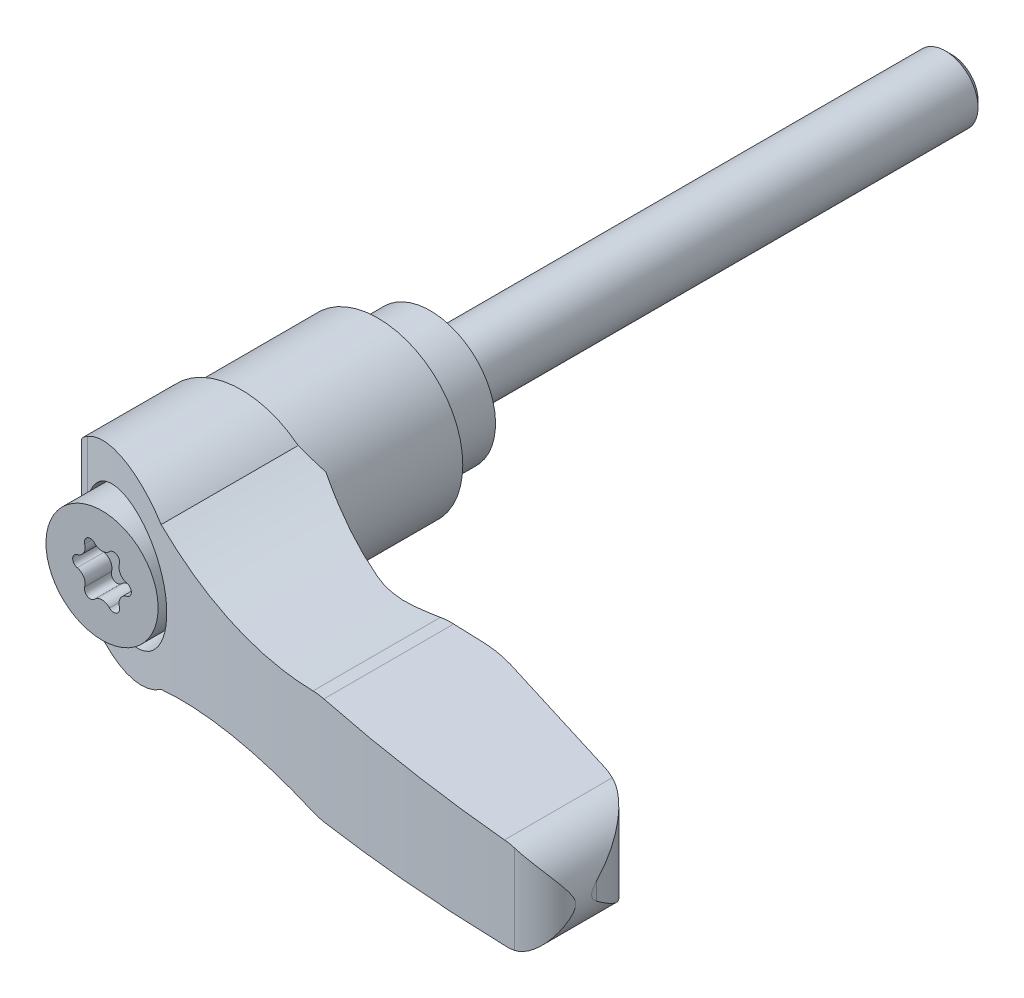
ISO-10303-21;
HEADER;
FILE_DESCRIPTION(('STEP AP214'),'2;1');
FILE_NAME('part.step','',(''),(''),'','','');
FILE_SCHEMA(('AUTOMOTIVE_DESIGN { 1 0 10303 214 1 1 1 1 }'));
ENDSEC;
DATA;
#1=APPLICATION_CONTEXT('core data for automotive mechanical design processes');
#2=APPLICATION_PROTOCOL_DEFINITION('international standard','automotive_design',2000,#1);
#3=PRODUCT_CONTEXT('',#1,'mechanical');
#4=PRODUCT('Part','Part','',(#3));
#5=PRODUCT_RELATED_PRODUCT_CATEGORY('part','',(#4));
#6=PRODUCT_DEFINITION_FORMATION('','',#4);
#7=PRODUCT_DEFINITION_CONTEXT('part definition',#1,'design');
#8=PRODUCT_DEFINITION('design','',#6,#7);
#9=PRODUCT_DEFINITION_SHAPE('','',#8);
#10=(LENGTH_UNIT() NAMED_UNIT(*) SI_UNIT(.MILLI.,.METRE.));
#11=(NAMED_UNIT(*) PLANE_ANGLE_UNIT() SI_UNIT($,.RADIAN.));
#12=(NAMED_UNIT(*) SI_UNIT($,.STERADIAN.) SOLID_ANGLE_UNIT());
#13=UNCERTAINTY_MEASURE_WITH_UNIT(LENGTH_MEASURE(1.E-05),#10,'distance_accuracy_value','');
#14=(GEOMETRIC_REPRESENTATION_CONTEXT(3) GLOBAL_UNCERTAINTY_ASSIGNED_CONTEXT((#13)) GLOBAL_UNIT_ASSIGNED_CONTEXT((#10,
#11,#12)) REPRESENTATION_CONTEXT('',''));
#15=CARTESIAN_POINT('',(0.,0.,0.));
#16=DIRECTION('',(0.,0.,1.));
#17=DIRECTION('',(1.,0.,0.));
#18=AXIS2_PLACEMENT_3D('',#15,#16,#17);
#19=CARTESIAN_POINT('',(2.008532,0.,-40.));
#20=DIRECTION('',(0.,0.,-1.));
#21=DIRECTION('',(0.,1.,0.));
#22=AXIS2_PLACEMENT_3D('',#19,#20,#21);
#23=PLANE('',#22);
#24=CARTESIAN_POINT('',(0.,0.,-40.));
#25=DIRECTION('',(0.,0.,1.));
#26=DIRECTION('',(0.,-1.,0.));
#27=AXIS2_PLACEMENT_3D('',#24,#25,#26);
#28=CIRCLE('',#27,2.008532);
#29=CARTESIAN_POINT('',(0.,-2.008532,-40.));
#30=VERTEX_POINT('',#29);
#31=EDGE_CURVE('E1387',#30,#30,#28,.T.);
#32=ORIENTED_EDGE('',*,*,#31,.F.);
#33=EDGE_LOOP('',(#32));
#34=FACE_BOUND('',#33,.T.);
#35=ADVANCED_FACE('F14',(#34),#23,.T.);
#36=CARTESIAN_POINT('',(0.,0.,-39.508532));
#37=DIRECTION('',(0.,0.,1.));
#38=DIRECTION('',(0.,-1.,0.));
#39=AXIS2_PLACEMENT_3D('',#36,#37,#38);
#40=CONICAL_SURFACE('',#39,2.5,0.785398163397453);
#41=ORIENTED_EDGE('',*,*,#31,.T.);
#42=EDGE_LOOP('',(#41));
#43=FACE_BOUND('',#42,.T.);
#44=CARTESIAN_POINT('',(0.,0.,-39.508532));
#45=DIRECTION('',(0.,0.,1.));
#46=DIRECTION('',(0.,-1.,0.));
#47=AXIS2_PLACEMENT_3D('',#44,#45,#46);
#48=CIRCLE('',#47,2.5);
#49=CARTESIAN_POINT('',(0.,-2.5,-39.508532));
#50=VERTEX_POINT('',#49);
#51=EDGE_CURVE('E1390',#50,#50,#48,.T.);
#52=ORIENTED_EDGE('',*,*,#51,.F.);
#53=EDGE_LOOP('',(#52));
#54=FACE_BOUND('',#53,.T.);
#55=ADVANCED_FACE('F534',(#43,#54),#40,.T.);
#56=CARTESIAN_POINT('',(0.,0.,4.));
#57=DIRECTION('',(0.,0.,1.));
#58=DIRECTION('',(0.,-1.,0.));
#59=AXIS2_PLACEMENT_3D('',#56,#57,#58);
#60=CYLINDRICAL_SURFACE('',#59,2.5);
#61=ORIENTED_EDGE('',*,*,#51,.T.);
#62=EDGE_LOOP('',(#61));
#63=FACE_BOUND('',#62,.T.);
#64=CARTESIAN_POINT('',(0.,0.,0.));
#65=DIRECTION('',(0.,0.,1.));
#66=DIRECTION('',(0.,-1.,0.));
#67=AXIS2_PLACEMENT_3D('',#64,#65,#66);
#68=CIRCLE('',#67,2.5);
#69=CARTESIAN_POINT('',(0.,-2.5,0.));
#70=VERTEX_POINT('',#69);
#71=EDGE_CURVE('E1393',#70,#70,#68,.T.);
#72=ORIENTED_EDGE('',*,*,#71,.F.);
#73=EDGE_LOOP('',(#72));
#74=FACE_BOUND('',#73,.T.);
#75=ADVANCED_FACE('F539',(#63,#74),#60,.T.);
#76=CARTESIAN_POINT('',(5.,0.,0.));
#77=DIRECTION('',(0.,0.,-1.));
#78=DIRECTION('',(0.,1.,0.));
#79=AXIS2_PLACEMENT_3D('',#76,#77,#78);
#80=PLANE('',#79);
#81=ORIENTED_EDGE('',*,*,#71,.T.);
#82=EDGE_LOOP('',(#81));
#83=FACE_BOUND('',#82,.T.);
#84=CARTESIAN_POINT('',(0.,0.,0.));
#85=DIRECTION('',(0.,0.,1.));
#86=DIRECTION('',(0.,-1.,0.));
#87=AXIS2_PLACEMENT_3D('',#84,#85,#86);
#88=CIRCLE('',#87,5.);
#89=CARTESIAN_POINT('',(0.,-5.,0.));
#90=VERTEX_POINT('',#89);
#91=EDGE_CURVE('E1396',#90,#90,#88,.T.);
#92=ORIENTED_EDGE('',*,*,#91,.F.);
#93=EDGE_LOOP('',(#92));
#94=FACE_BOUND('',#93,.T.);
#95=ADVANCED_FACE('F488',(#83,#94),#80,.T.);
#96=CARTESIAN_POINT('',(0.,0.,4.));
#97=DIRECTION('',(0.,0.,1.));
#98=DIRECTION('',(0.,-1.,0.));
#99=AXIS2_PLACEMENT_3D('',#96,#97,#98);
#100=CYLINDRICAL_SURFACE('',#99,5.);
#101=ORIENTED_EDGE('',*,*,#91,.T.);
#102=EDGE_LOOP('',(#101));
#103=FACE_BOUND('',#102,.T.);
#104=CARTESIAN_POINT('',(0.,0.,4.55));
#105=DIRECTION('',(0.,0.,-1.));
#106=DIRECTION('',(1.,0.,0.));
#107=AXIS2_PLACEMENT_3D('',#104,#105,#106);
#108=CIRCLE('',#107,5.);
#109=CARTESIAN_POINT('',(5.,0.,4.55));
#110=VERTEX_POINT('',#109);
#111=EDGE_CURVE('E9',#110,#110,#108,.T.);
#112=ORIENTED_EDGE('',*,*,#111,.T.);
#113=EDGE_LOOP('',(#112));
#114=FACE_BOUND('',#113,.T.);
#115=ADVANCED_FACE('F478',(#103,#114),#100,.T.);
#116=CARTESIAN_POINT('',(-1.94278209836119,0.602050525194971,23.12));
#117=DIRECTION('',(0.,0.,-1.));
#118=DIRECTION('',(0.,1.,0.));
#119=AXIS2_PLACEMENT_3D('',#116,#117,#118);
#120=PLANE('',#119);
#121=CARTESIAN_POINT('',(-2.08556419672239,1.20410105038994,23.12));
#122=DIRECTION('',(0.,0.,-1.));
#123=DIRECTION('',(-1.,0.,0.));
#124=AXIS2_PLACEMENT_3D('',#121,#122,#123);
#125=CIRCLE('',#124,0.787499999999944);
#126=CARTESIAN_POINT('',(-1.3311142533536,1.4298476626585,23.12));
#127=VERTEX_POINT('',#126);
#128=CARTESIAN_POINT('',(-1.9038415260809,0.43785492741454,23.12));
#129=VERTEX_POINT('',#128);
#130=EDGE_CURVE('E1321',#127,#129,#125,.T.);
#131=ORIENTED_EDGE('',*,*,#130,.T.);
#132=CARTESIAN_POINT('',(-1.8,0.,23.12));
#133=DIRECTION('',(0.,0.,1.));
#134=DIRECTION('',(1.,0.,0.));
#135=AXIS2_PLACEMENT_3D('',#132,#133,#134);
#136=CIRCLE('',#135,0.45);
#137=CARTESIAN_POINT('',(-1.9038415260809,-0.43785492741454,23.12));
#138=VERTEX_POINT('',#137);
#139=EDGE_CURVE('E1325',#129,#138,#136,.T.);
#140=ORIENTED_EDGE('',*,*,#139,.T.);
#141=CARTESIAN_POINT('',(-2.08556419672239,-1.20410105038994,23.12));
#142=DIRECTION('',(0.,0.,-1.));
#143=DIRECTION('',(-1.,0.,0.));
#144=AXIS2_PLACEMENT_3D('',#141,#142,#143);
#145=CIRCLE('',#144,0.787499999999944);
#146=CARTESIAN_POINT('',(-1.3311142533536,-1.4298476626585,23.12));
#147=VERTEX_POINT('',#146);
#148=EDGE_CURVE('E267',#138,#147,#145,.T.);
#149=ORIENTED_EDGE('',*,*,#148,.T.);
#150=CARTESIAN_POINT('',(-0.899999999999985,-1.55884572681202,23.12));
#151=DIRECTION('',(0.,0.,1.));
#152=DIRECTION('',(1.,0.,0.));
#153=AXIS2_PLACEMENT_3D('',#150,#151,#152);
#154=CIRCLE('',#153,0.45);
#155=CARTESIAN_POINT('',(-0.57272727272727,-1.8677025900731,23.12));
#156=VERTEX_POINT('',#155);
#157=EDGE_CURVE('E1332',#147,#156,#154,.T.);
#158=ORIENTED_EDGE('',*,*,#157,.T.);
#159=CARTESIAN_POINT('',(0.,-2.40820210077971,23.12));
#160=DIRECTION('',(0.,0.,-1.));
#161=DIRECTION('',(-1.,0.,0.));
#162=AXIS2_PLACEMENT_3D('',#159,#160,#161);
#163=CIRCLE('',#162,0.787499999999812);
#164=CARTESIAN_POINT('',(0.57272727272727,-1.8677025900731,23.12));
#165=VERTEX_POINT('',#164);
#166=EDGE_CURVE('E1336',#156,#165,#163,.T.);
#167=ORIENTED_EDGE('',*,*,#166,.T.);
#168=CARTESIAN_POINT('',(0.899999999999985,-1.55884572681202,23.12));
#169=DIRECTION('',(0.,0.,1.));
#170=DIRECTION('',(-1.,0.,0.));
#171=AXIS2_PLACEMENT_3D('',#168,#169,#170);
#172=CIRCLE('',#171,0.45);
#173=CARTESIAN_POINT('',(1.3311142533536,-1.4298476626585,23.12));
#174=VERTEX_POINT('',#173);
#175=EDGE_CURVE('E1340',#165,#174,#172,.T.);
#176=ORIENTED_EDGE('',*,*,#175,.T.);
#177=CARTESIAN_POINT('',(2.08556419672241,-1.20410105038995,23.12));
#178=DIRECTION('',(0.,0.,-1.));
#179=DIRECTION('',(1.,0.,0.));
#180=AXIS2_PLACEMENT_3D('',#177,#178,#179);
#181=CIRCLE('',#180,0.787499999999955);
#182=CARTESIAN_POINT('',(1.9038415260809,-0.43785492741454,23.12));
#183=VERTEX_POINT('',#182);
#184=EDGE_CURVE('E1344',#174,#183,#181,.T.);
#185=ORIENTED_EDGE('',*,*,#184,.T.);
#186=CARTESIAN_POINT('',(1.8,0.,23.12));
#187=DIRECTION('',(0.,0.,1.));
#188=DIRECTION('',(-1.,0.,0.));
#189=AXIS2_PLACEMENT_3D('',#186,#187,#188);
#190=CIRCLE('',#189,0.45);
#191=CARTESIAN_POINT('',(1.9038415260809,0.43785492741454,23.12));
#192=VERTEX_POINT('',#191);
#193=EDGE_CURVE('E1348',#183,#192,#190,.T.);
#194=ORIENTED_EDGE('',*,*,#193,.T.);
#195=CARTESIAN_POINT('',(2.08556419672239,1.20410105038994,23.12));
#196=DIRECTION('',(0.,0.,-1.));
#197=DIRECTION('',(1.,0.,0.));
#198=AXIS2_PLACEMENT_3D('',#195,#196,#197);
#199=CIRCLE('',#198,0.787499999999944);
#200=CARTESIAN_POINT('',(1.3311142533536,1.4298476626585,23.12));
#201=VERTEX_POINT('',#200);
#202=EDGE_CURVE('E1352',#192,#201,#199,.T.);
#203=ORIENTED_EDGE('',*,*,#202,.T.);
#204=CARTESIAN_POINT('',(0.899999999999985,1.55884572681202,23.12));
#205=DIRECTION('',(0.,0.,1.));
#206=DIRECTION('',(-1.,0.,0.));
#207=AXIS2_PLACEMENT_3D('',#204,#205,#206);
#208=CIRCLE('',#207,0.45);
#209=CARTESIAN_POINT('',(0.57272727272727,1.8677025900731,23.12));
#210=VERTEX_POINT('',#209);
#211=EDGE_CURVE('E1356',#201,#210,#208,.T.);
#212=ORIENTED_EDGE('',*,*,#211,.T.);
#213=CARTESIAN_POINT('',(0.,2.40820210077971,23.12));
#214=DIRECTION('',(0.,0.,-1.));
#215=DIRECTION('',(-1.,0.,0.));
#216=AXIS2_PLACEMENT_3D('',#213,#214,#215);
#217=CIRCLE('',#216,0.787499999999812);
#218=CARTESIAN_POINT('',(-0.57272727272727,1.8677025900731,23.12));
#219=VERTEX_POINT('',#218);
#220=EDGE_CURVE('E1360',#210,#219,#217,.T.);
#221=ORIENTED_EDGE('',*,*,#220,.T.);
#222=CARTESIAN_POINT('',(-0.899999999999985,1.55884572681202,23.12));
#223=DIRECTION('',(0.,0.,1.));
#224=DIRECTION('',(1.,0.,0.));
#225=AXIS2_PLACEMENT_3D('',#222,#223,#224);
#226=CIRCLE('',#225,0.45);
#227=EDGE_CURVE('E1364',#219,#127,#226,.T.);
#228=ORIENTED_EDGE('',*,*,#227,.T.);
#229=EDGE_LOOP('',(#131,#140,#149,#158,#167,#176,#185,#194,#203,#212,#221,#228));
#230=FACE_BOUND('',#229,.T.);
#231=ADVANCED_FACE('F476',(#230),#120,.F.);
#232=CARTESIAN_POINT('',(-2.08556419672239,-1.20410105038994,27.24));
#233=DIRECTION('',(0.,0.,-1.));
#234=DIRECTION('',(0.,1.,0.));
#235=AXIS2_PLACEMENT_3D('',#232,#233,#234);
#236=CYLINDRICAL_SURFACE('',#235,0.787499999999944);
#237=DIRECTION('',(0.,0.,-1.));
#238=VECTOR('',#237,1.);
#239=CARTESIAN_POINT('',(-1.3311142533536,-1.4298476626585,27.24));
#240=LINE('',#239,#238);
#241=CARTESIAN_POINT('',(-1.3311142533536,-1.4298476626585,25.18));
#242=VERTEX_POINT('',#241);
#243=EDGE_CURVE('E268',#242,#147,#240,.T.);
#244=ORIENTED_EDGE('',*,*,#243,.T.);
#245=ORIENTED_EDGE('',*,*,#148,.F.);
#246=DIRECTION('',(0.,0.,-1.));
#247=VECTOR('',#246,1.);
#248=CARTESIAN_POINT('',(-1.9038415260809,-0.43785492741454,27.24));
#249=LINE('',#248,#247);
#250=CARTESIAN_POINT('',(-1.9038415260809,-0.43785492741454,25.18));
#251=VERTEX_POINT('',#250);
#252=EDGE_CURVE('E255',#251,#138,#249,.T.);
#253=ORIENTED_EDGE('',*,*,#252,.F.);
#254=CARTESIAN_POINT('',(-2.08556419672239,-1.20410105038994,25.18));
#255=DIRECTION('',(0.,0.,1.));
#256=DIRECTION('',(0.,-1.,0.));
#257=AXIS2_PLACEMENT_3D('',#254,#255,#256);
#258=CIRCLE('',#257,0.787499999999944);
#259=EDGE_CURVE('E260',#242,#251,#258,.T.);
#260=ORIENTED_EDGE('',*,*,#259,.F.);
#261=EDGE_LOOP('',(#244,#245,#253,#260));
#262=FACE_BOUND('',#261,.T.);
#263=ADVANCED_FACE('F264',(#262),#236,.T.);
#264=CARTESIAN_POINT('',(-0.899999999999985,-1.55884572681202,27.24));
#265=DIRECTION('',(0.,0.,-1.));
#266=DIRECTION('',(0.,1.,0.));
#267=AXIS2_PLACEMENT_3D('',#264,#265,#266);
#268=CYLINDRICAL_SURFACE('',#267,0.45);
#269=DIRECTION('',(0.,0.,-1.));
#270=VECTOR('',#269,1.);
#271=CARTESIAN_POINT('',(-0.57272727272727,-1.8677025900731,27.24));
#272=LINE('',#271,#270);
#273=CARTESIAN_POINT('',(-0.57272727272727,-1.8677025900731,25.18));
#274=VERTEX_POINT('',#273);
#275=EDGE_CURVE('E1383',#274,#156,#272,.T.);
#276=ORIENTED_EDGE('',*,*,#275,.T.);
#277=ORIENTED_EDGE('',*,*,#157,.F.);
#278=ORIENTED_EDGE('',*,*,#243,.F.);
#279=CARTESIAN_POINT('',(-0.899999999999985,-1.55884572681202,25.18));
#280=DIRECTION('',(0.,0.,1.));
#281=DIRECTION('',(0.,-1.,0.));
#282=AXIS2_PLACEMENT_3D('',#279,#280,#281);
#283=CIRCLE('',#282,0.45);
#284=EDGE_CURVE('E273',#274,#242,#283,.F.);
#285=ORIENTED_EDGE('',*,*,#284,.F.);
#286=EDGE_LOOP('',(#276,#277,#278,#285));
#287=FACE_BOUND('',#286,.T.);
#288=ADVANCED_FACE('F486',(#287),#268,.F.);
#289=CARTESIAN_POINT('',(0.,-2.40820210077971,27.24));
#290=DIRECTION('',(0.,0.,-1.));
#291=DIRECTION('',(0.,1.,0.));
#292=AXIS2_PLACEMENT_3D('',#289,#290,#291);
#293=CYLINDRICAL_SURFACE('',#292,0.787499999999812);
#294=DIRECTION('',(0.,0.,-1.));
#295=VECTOR('',#294,1.);
#296=CARTESIAN_POINT('',(0.57272727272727,-1.8677025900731,27.24));
#297=LINE('',#296,#295);
#298=CARTESIAN_POINT('',(0.57272727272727,-1.8677025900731,25.18));
#299=VERTEX_POINT('',#298);
#300=EDGE_CURVE('E1381',#299,#165,#297,.T.);
#301=ORIENTED_EDGE('',*,*,#300,.T.);
#302=ORIENTED_EDGE('',*,*,#166,.F.);
#303=ORIENTED_EDGE('',*,*,#275,.F.);
#304=CARTESIAN_POINT('',(0.,-2.40820210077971,25.18));
#305=DIRECTION('',(0.,0.,1.));
#306=DIRECTION('',(0.,-1.,0.));
#307=AXIS2_PLACEMENT_3D('',#304,#305,#306);
#308=CIRCLE('',#307,0.787499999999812);
#309=EDGE_CURVE('E275',#299,#274,#308,.T.);
#310=ORIENTED_EDGE('',*,*,#309,.F.);
#311=EDGE_LOOP('',(#301,#302,#303,#310));
#312=FACE_BOUND('',#311,.T.);
#313=ADVANCED_FACE('F520',(#312),#293,.T.);
#314=CARTESIAN_POINT('',(0.899999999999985,-1.55884572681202,27.24));
#315=DIRECTION('',(0.,0.,-1.));
#316=DIRECTION('',(0.,1.,0.));
#317=AXIS2_PLACEMENT_3D('',#314,#315,#316);
#318=CYLINDRICAL_SURFACE('',#317,0.45);
#319=DIRECTION('',(0.,0.,-1.));
#320=VECTOR('',#319,1.);
#321=CARTESIAN_POINT('',(1.3311142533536,-1.4298476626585,27.24));
#322=LINE('',#321,#320);
#323=CARTESIAN_POINT('',(1.3311142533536,-1.4298476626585,25.18));
#324=VERTEX_POINT('',#323);
#325=EDGE_CURVE('E1379',#324,#174,#322,.T.);
#326=ORIENTED_EDGE('',*,*,#325,.T.);
#327=ORIENTED_EDGE('',*,*,#175,.F.);
#328=ORIENTED_EDGE('',*,*,#300,.F.);
#329=CARTESIAN_POINT('',(0.899999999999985,-1.55884572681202,25.18));
#330=DIRECTION('',(0.,0.,1.));
#331=DIRECTION('',(0.,-1.,0.));
#332=AXIS2_PLACEMENT_3D('',#329,#330,#331);
#333=CIRCLE('',#332,0.45);
#334=EDGE_CURVE('E1420',#324,#299,#333,.F.);
#335=ORIENTED_EDGE('',*,*,#334,.F.);
#336=EDGE_LOOP('',(#326,#327,#328,#335));
#337=FACE_BOUND('',#336,.T.);
#338=ADVANCED_FACE('F516',(#337),#318,.F.);
#339=CARTESIAN_POINT('',(2.08556419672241,-1.20410105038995,27.24));
#340=DIRECTION('',(0.,0.,-1.));
#341=DIRECTION('',(0.,1.,0.));
#342=AXIS2_PLACEMENT_3D('',#339,#340,#341);
#343=CYLINDRICAL_SURFACE('',#342,0.787499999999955);
#344=DIRECTION('',(0.,0.,-1.));
#345=VECTOR('',#344,1.);
#346=CARTESIAN_POINT('',(1.9038415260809,-0.43785492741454,27.24));
#347=LINE('',#346,#345);
#348=CARTESIAN_POINT('',(1.9038415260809,-0.43785492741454,25.18));
#349=VERTEX_POINT('',#348);
#350=EDGE_CURVE('E1377',#349,#183,#347,.T.);
#351=ORIENTED_EDGE('',*,*,#350,.T.);
#352=ORIENTED_EDGE('',*,*,#184,.F.);
#353=ORIENTED_EDGE('',*,*,#325,.F.);
#354=CARTESIAN_POINT('',(2.08556419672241,-1.20410105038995,25.18));
#355=DIRECTION('',(0.,0.,1.));
#356=DIRECTION('',(0.,-1.,0.));
#357=AXIS2_PLACEMENT_3D('',#354,#355,#356);
#358=CIRCLE('',#357,0.787499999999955);
#359=EDGE_CURVE('E1417',#349,#324,#358,.T.);
#360=ORIENTED_EDGE('',*,*,#359,.F.);
#361=EDGE_LOOP('',(#351,#352,#353,#360));
#362=FACE_BOUND('',#361,.T.);
#363=ADVANCED_FACE('F512',(#362),#343,.T.);
#364=CARTESIAN_POINT('',(1.8,0.,27.24));
#365=DIRECTION('',(0.,0.,-1.));
#366=DIRECTION('',(0.,1.,0.));
#367=AXIS2_PLACEMENT_3D('',#364,#365,#366);
#368=CYLINDRICAL_SURFACE('',#367,0.45);
#369=DIRECTION('',(0.,0.,-1.));
#370=VECTOR('',#369,1.);
#371=CARTESIAN_POINT('',(1.9038415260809,0.43785492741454,27.24));
#372=LINE('',#371,#370);
#373=CARTESIAN_POINT('',(1.9038415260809,0.43785492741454,25.18));
#374=VERTEX_POINT('',#373);
#375=EDGE_CURVE('E1375',#374,#192,#372,.T.);
#376=ORIENTED_EDGE('',*,*,#375,.T.);
#377=ORIENTED_EDGE('',*,*,#193,.F.);
#378=ORIENTED_EDGE('',*,*,#350,.F.);
#379=CARTESIAN_POINT('',(1.8,0.,25.18));
#380=DIRECTION('',(0.,0.,1.));
#381=DIRECTION('',(0.,-1.,0.));
#382=AXIS2_PLACEMENT_3D('',#379,#380,#381);
#383=CIRCLE('',#382,0.45);
#384=EDGE_CURVE('E1414',#374,#349,#383,.F.);
#385=ORIENTED_EDGE('',*,*,#384,.F.);
#386=EDGE_LOOP('',(#376,#377,#378,#385));
#387=FACE_BOUND('',#386,.T.);
#388=ADVANCED_FACE('F508',(#387),#368,.F.);
#389=CARTESIAN_POINT('',(2.08556419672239,1.20410105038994,27.24));
#390=DIRECTION('',(0.,0.,-1.));
#391=DIRECTION('',(0.,1.,0.));
#392=AXIS2_PLACEMENT_3D('',#389,#390,#391);
#393=CYLINDRICAL_SURFACE('',#392,0.787499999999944);
#394=DIRECTION('',(0.,0.,-1.));
#395=VECTOR('',#394,1.);
#396=CARTESIAN_POINT('',(1.3311142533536,1.4298476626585,27.24));
#397=LINE('',#396,#395);
#398=CARTESIAN_POINT('',(1.3311142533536,1.4298476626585,25.18));
#399=VERTEX_POINT('',#398);
#400=EDGE_CURVE('E1373',#399,#201,#397,.T.);
#401=ORIENTED_EDGE('',*,*,#400,.T.);
#402=ORIENTED_EDGE('',*,*,#202,.F.);
#403=ORIENTED_EDGE('',*,*,#375,.F.);
#404=CARTESIAN_POINT('',(2.08556419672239,1.20410105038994,25.18));
#405=DIRECTION('',(0.,0.,1.));
#406=DIRECTION('',(0.,-1.,0.));
#407=AXIS2_PLACEMENT_3D('',#404,#405,#406);
#408=CIRCLE('',#407,0.787499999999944);
#409=EDGE_CURVE('E1411',#399,#374,#408,.T.);
#410=ORIENTED_EDGE('',*,*,#409,.F.);
#411=EDGE_LOOP('',(#401,#402,#403,#410));
#412=FACE_BOUND('',#411,.T.);
#413=ADVANCED_FACE('F504',(#412),#393,.T.);
#414=CARTESIAN_POINT('',(0.899999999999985,1.55884572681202,27.24));
#415=DIRECTION('',(0.,0.,-1.));
#416=DIRECTION('',(0.,1.,0.));
#417=AXIS2_PLACEMENT_3D('',#414,#415,#416);
#418=CYLINDRICAL_SURFACE('',#417,0.45);
#419=DIRECTION('',(0.,0.,-1.));
#420=VECTOR('',#419,1.);
#421=CARTESIAN_POINT('',(0.57272727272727,1.8677025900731,27.24));
#422=LINE('',#421,#420);
#423=CARTESIAN_POINT('',(0.57272727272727,1.8677025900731,25.18));
#424=VERTEX_POINT('',#423);
#425=EDGE_CURVE('E1371',#424,#210,#422,.T.);
#426=ORIENTED_EDGE('',*,*,#425,.T.);
#427=ORIENTED_EDGE('',*,*,#211,.F.);
#428=ORIENTED_EDGE('',*,*,#400,.F.);
#429=CARTESIAN_POINT('',(0.899999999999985,1.55884572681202,25.18));
#430=DIRECTION('',(0.,0.,1.));
#431=DIRECTION('',(0.,-1.,0.));
#432=AXIS2_PLACEMENT_3D('',#429,#430,#431);
#433=CIRCLE('',#432,0.45);
#434=EDGE_CURVE('E1408',#424,#399,#433,.F.);
#435=ORIENTED_EDGE('',*,*,#434,.F.);
#436=EDGE_LOOP('',(#426,#427,#428,#435));
#437=FACE_BOUND('',#436,.T.);
#438=ADVANCED_FACE('F500',(#437),#418,.F.);
#439=CARTESIAN_POINT('',(0.,2.40820210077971,27.24));
#440=DIRECTION('',(0.,0.,-1.));
#441=DIRECTION('',(0.,1.,0.));
#442=AXIS2_PLACEMENT_3D('',#439,#440,#441);
#443=CYLINDRICAL_SURFACE('',#442,0.787499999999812);
#444=DIRECTION('',(0.,0.,-1.));
#445=VECTOR('',#444,1.);
#446=CARTESIAN_POINT('',(-0.57272727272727,1.8677025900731,27.24));
#447=LINE('',#446,#445);
#448=CARTESIAN_POINT('',(-0.57272727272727,1.8677025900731,25.18));
#449=VERTEX_POINT('',#448);
#450=EDGE_CURVE('E39',#449,#219,#447,.T.);
#451=ORIENTED_EDGE('',*,*,#450,.T.);
#452=ORIENTED_EDGE('',*,*,#220,.F.);
#453=ORIENTED_EDGE('',*,*,#425,.F.);
#454=CARTESIAN_POINT('',(0.,2.40820210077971,25.18));
#455=DIRECTION('',(0.,0.,1.));
#456=DIRECTION('',(0.,-1.,0.));
#457=AXIS2_PLACEMENT_3D('',#454,#455,#456);
#458=CIRCLE('',#457,0.787499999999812);
#459=EDGE_CURVE('E1405',#449,#424,#458,.T.);
#460=ORIENTED_EDGE('',*,*,#459,.F.);
#461=EDGE_LOOP('',(#451,#452,#453,#460));
#462=FACE_BOUND('',#461,.T.);
#463=ADVANCED_FACE('F497',(#462),#443,.T.);
#464=CARTESIAN_POINT('',(-0.899999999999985,1.55884572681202,27.24));
#465=DIRECTION('',(0.,0.,-1.));
#466=DIRECTION('',(0.,1.,0.));
#467=AXIS2_PLACEMENT_3D('',#464,#465,#466);
#468=CYLINDRICAL_SURFACE('',#467,0.45);
#469=DIRECTION('',(0.,0.,-1.));
#470=VECTOR('',#469,1.);
#471=CARTESIAN_POINT('',(-1.3311142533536,1.4298476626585,27.24));
#472=LINE('',#471,#470);
#473=CARTESIAN_POINT('',(-1.3311142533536,1.4298476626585,25.18));
#474=VERTEX_POINT('',#473);
#475=EDGE_CURVE('E1367',#474,#127,#472,.T.);
#476=ORIENTED_EDGE('',*,*,#475,.T.);
#477=ORIENTED_EDGE('',*,*,#227,.F.);
#478=ORIENTED_EDGE('',*,*,#450,.F.);
#479=CARTESIAN_POINT('',(-0.899999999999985,1.55884572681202,25.18));
#480=DIRECTION('',(0.,0.,1.));
#481=DIRECTION('',(0.,-1.,0.));
#482=AXIS2_PLACEMENT_3D('',#479,#480,#481);
#483=CIRCLE('',#482,0.45);
#484=EDGE_CURVE('E1402',#474,#449,#483,.F.);
#485=ORIENTED_EDGE('',*,*,#484,.F.);
#486=EDGE_LOOP('',(#476,#477,#478,#485));
#487=FACE_BOUND('',#486,.T.);
#488=ADVANCED_FACE('F493',(#487),#468,.F.);
#489=CARTESIAN_POINT('',(-2.08556419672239,1.20410105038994,27.24));
#490=DIRECTION('',(0.,0.,-1.));
#491=DIRECTION('',(0.,1.,0.));
#492=AXIS2_PLACEMENT_3D('',#489,#490,#491);
#493=CYLINDRICAL_SURFACE('',#492,0.787499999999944);
#494=DIRECTION('',(0.,0.,-1.));
#495=VECTOR('',#494,1.);
#496=CARTESIAN_POINT('',(-1.9038415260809,0.43785492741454,27.24));
#497=LINE('',#496,#495);
#498=CARTESIAN_POINT('',(-1.9038415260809,0.43785492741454,25.18));
#499=VERTEX_POINT('',#498);
#500=EDGE_CURVE('E190',#499,#129,#497,.T.);
#501=ORIENTED_EDGE('',*,*,#500,.T.);
#502=ORIENTED_EDGE('',*,*,#130,.F.);
#503=ORIENTED_EDGE('',*,*,#475,.F.);
#504=CARTESIAN_POINT('',(-2.08556419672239,1.20410105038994,25.18));
#505=DIRECTION('',(0.,0.,1.));
#506=DIRECTION('',(0.,-1.,0.));
#507=AXIS2_PLACEMENT_3D('',#504,#505,#506);
#508=CIRCLE('',#507,0.787499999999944);
#509=EDGE_CURVE('E30',#499,#474,#508,.T.);
#510=ORIENTED_EDGE('',*,*,#509,.F.);
#511=EDGE_LOOP('',(#501,#502,#503,#510));
#512=FACE_BOUND('',#511,.T.);
#513=ADVANCED_FACE('F496',(#512),#493,.T.);
#514=CARTESIAN_POINT('',(-1.8,0.,27.24));
#515=DIRECTION('',(0.,0.,-1.));
#516=DIRECTION('',(0.,1.,0.));
#517=AXIS2_PLACEMENT_3D('',#514,#515,#516);
#518=CYLINDRICAL_SURFACE('',#517,0.45);
#519=ORIENTED_EDGE('',*,*,#252,.T.);
#520=ORIENTED_EDGE('',*,*,#139,.F.);
#521=ORIENTED_EDGE('',*,*,#500,.F.);
#522=CARTESIAN_POINT('',(-1.8,0.,25.18));
#523=DIRECTION('',(0.,0.,1.));
#524=DIRECTION('',(0.,-1.,0.));
#525=AXIS2_PLACEMENT_3D('',#522,#523,#524);
#526=CIRCLE('',#525,0.45);
#527=EDGE_CURVE('E252',#251,#499,#526,.F.);
#528=ORIENTED_EDGE('',*,*,#527,.F.);
#529=EDGE_LOOP('',(#519,#520,#521,#528));
#530=FACE_BOUND('',#529,.T.);
#531=ADVANCED_FACE('F254',(#530),#518,.F.);
#532=CARTESIAN_POINT('',(0.,0.,25.18));
#533=DIRECTION('',(0.,0.,1.));
#534=DIRECTION('',(0.,-1.,0.));
#535=AXIS2_PLACEMENT_3D('',#532,#533,#534);
#536=PLANE('',#535);
#537=CARTESIAN_POINT('',(0.,0.,25.18));
#538=DIRECTION('',(0.,0.,1.));
#539=DIRECTION('',(0.,-1.,0.));
#540=AXIS2_PLACEMENT_3D('',#537,#538,#539);
#541=CIRCLE('',#540,4.3);
#542=CARTESIAN_POINT('',(0.,-4.3,25.18));
#543=VERTEX_POINT('',#542);
#544=EDGE_CURVE('E1399',#543,#543,#541,.T.);
#545=ORIENTED_EDGE('',*,*,#544,.T.);
#546=EDGE_LOOP('',(#545));
#547=FACE_BOUND('',#546,.T.);
#548=ORIENTED_EDGE('',*,*,#527,.T.);
#549=ORIENTED_EDGE('',*,*,#509,.T.);
#550=ORIENTED_EDGE('',*,*,#484,.T.);
#551=ORIENTED_EDGE('',*,*,#459,.T.);
#552=ORIENTED_EDGE('',*,*,#434,.T.);
#553=ORIENTED_EDGE('',*,*,#409,.T.);
#554=ORIENTED_EDGE('',*,*,#384,.T.);
#555=ORIENTED_EDGE('',*,*,#359,.T.);
#556=ORIENTED_EDGE('',*,*,#334,.T.);
#557=ORIENTED_EDGE('',*,*,#309,.T.);
#558=ORIENTED_EDGE('',*,*,#284,.T.);
#559=ORIENTED_EDGE('',*,*,#259,.T.);
#560=EDGE_LOOP('',(#548,#549,#550,#551,#552,#553,#554,#555,#556,#557,#558,#559));
#561=FACE_BOUND('',#560,.T.);
#562=ADVANCED_FACE('F271',(#547,#561),#536,.T.);
#563=CARTESIAN_POINT('',(0.,0.,4.));
#564=DIRECTION('',(0.,0.,1.));
#565=DIRECTION('',(0.,-1.,0.));
#566=AXIS2_PLACEMENT_3D('',#563,#564,#565);
#567=CYLINDRICAL_SURFACE('',#566,4.3);
#568=CARTESIAN_POINT('',(0.,0.,21.34));
#569=DIRECTION('',(0.,0.,-1.));
#570=DIRECTION('',(0.,1.,0.));
#571=AXIS2_PLACEMENT_3D('',#568,#569,#570);
#572=CIRCLE('',#571,4.3);
#573=CARTESIAN_POINT('',(0.,4.3,21.34));
#574=VERTEX_POINT('',#573);
#575=EDGE_CURVE('E571',#574,#574,#572,.F.);
#576=ORIENTED_EDGE('',*,*,#575,.T.);
#577=EDGE_LOOP('',(#576));
#578=FACE_BOUND('',#577,.T.);
#579=ORIENTED_EDGE('',*,*,#544,.F.);
#580=EDGE_LOOP('',(#579));
#581=FACE_BOUND('',#580,.T.);
#582=ADVANCED_FACE('F547',(#578,#581),#567,.T.);
#583=CARTESIAN_POINT('',(-0.009999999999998,0.,16.5625));
#584=DIRECTION('',(0.,0.,-1.));
#585=DIRECTION('',(1.,0.,0.));
#586=AXIS2_PLACEMENT_3D('',#583,#584,#585);
#587=CYLINDRICAL_SURFACE('',#586,6.5);
#588=CARTESIAN_POINT('',(-0.0099999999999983,0.,14.5));
#589=DIRECTION('',(0.,0.,1.));
#590=DIRECTION('',(0.,-1.,0.));
#591=AXIS2_PLACEMENT_3D('',#588,#589,#590);
#592=CIRCLE('',#591,6.5);
#593=CARTESIAN_POINT('',(-6.51,0.,14.5));
#594=VERTEX_POINT('',#593);
#595=CARTESIAN_POINT('',(6.49,0.,14.5));
#596=VERTEX_POINT('',#595);
#597=EDGE_CURVE('E638',#594,#596,#592,.T.);
#598=ORIENTED_EDGE('',*,*,#597,.F.);
#599=EDGE_CURVE('E637',#596,#594,#592,.T.);
#600=ORIENTED_EDGE('',*,*,#599,.F.);
#601=EDGE_LOOP('',(#598,#600));
#602=FACE_BOUND('',#601,.T.);
#603=CARTESIAN_POINT('',(-0.0100000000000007,0.,-2.35002265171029));
#604=DIRECTION('',(0.707106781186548,0.,0.707106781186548));
#605=DIRECTION('',(0.707106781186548,0.,-0.707106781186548));
#606=AXIS2_PLACEMENT_3D('',#603,#604,#605);
#607=ELLIPSE('',#606,9.19238815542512,6.5);
#608=CARTESIAN_POINT('',(-6.3600226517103,-1.38824072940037,4.));
#609=VERTEX_POINT('',#608);
#610=CARTESIAN_POINT('',(-6.3600226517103,1.38824072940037,4.));
#611=VERTEX_POINT('',#610);
#612=EDGE_CURVE('E758',#609,#611,#607,.F.);
#613=ORIENTED_EDGE('',*,*,#612,.F.);
#614=CARTESIAN_POINT('',(-0.0099999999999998,0.,4.));
#615=DIRECTION('',(0.,0.,-1.));
#616=DIRECTION('',(1.,0.,0.));
#617=AXIS2_PLACEMENT_3D('',#614,#615,#616);
#618=CIRCLE('',#617,6.5);
#619=EDGE_CURVE('E176',#611,#609,#618,.T.);
#620=ORIENTED_EDGE('',*,*,#619,.F.);
#621=EDGE_LOOP('',(#613,#620));
#622=FACE_BOUND('',#621,.T.);
#623=ADVANCED_FACE('F308',(#602,#622),#587,.T.);
#624=CARTESIAN_POINT('',(-6.51,-14.,4.1499773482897));
#625=DIRECTION('',(0.707106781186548,0.,0.707106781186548));
#626=DIRECTION('',(-0.707106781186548,0.,0.707106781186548));
#627=AXIS2_PLACEMENT_3D('',#624,#625,#626);
#628=PLANE('',#627);
#629=ORIENTED_EDGE('',*,*,#612,.T.);
#630=DIRECTION('',(0.,1.,0.));
#631=VECTOR('',#630,1.);
#632=CARTESIAN_POINT('',(-6.3600226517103,-14.,4.));
#633=LINE('',#632,#631);
#634=EDGE_CURVE('E289',#609,#611,#633,.T.);
#635=ORIENTED_EDGE('',*,*,#634,.F.);
#636=EDGE_LOOP('',(#629,#635));
#637=FACE_BOUND('',#636,.T.);
#638=ADVANCED_FACE('F302',(#637),#628,.F.);
#639=CARTESIAN_POINT('',(-0.0099999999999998,0.,4.));
#640=DIRECTION('',(0.,0.,-1.));
#641=DIRECTION('',(1.,0.,0.));
#642=AXIS2_PLACEMENT_3D('',#639,#640,#641);
#643=PLANE('',#642);
#644=CARTESIAN_POINT('',(0.,0.,4.));
#645=DIRECTION('',(0.,0.,-1.));
#646=DIRECTION('',(1.,0.,0.));
#647=AXIS2_PLACEMENT_3D('',#644,#645,#646);
#648=CIRCLE('',#647,5.25);
#649=CARTESIAN_POINT('',(5.25,0.,4.));
#650=VERTEX_POINT('',#649);
#651=EDGE_CURVE('E566',#650,#650,#648,.T.);
#652=ORIENTED_EDGE('',*,*,#651,.F.);
#653=EDGE_LOOP('',(#652));
#654=FACE_BOUND('',#653,.T.);
#655=ORIENTED_EDGE('',*,*,#634,.T.);
#656=ORIENTED_EDGE('',*,*,#619,.T.);
#657=EDGE_LOOP('',(#655,#656));
#658=FACE_BOUND('',#657,.T.);
#659=ADVANCED_FACE('F307',(#654,#658),#643,.T.);
#660=CARTESIAN_POINT('',(0.,0.,4.));
#661=DIRECTION('',(0.,0.,1.));
#662=DIRECTION('',(0.,-1.,0.));
#663=AXIS2_PLACEMENT_3D('',#660,#661,#662);
#664=CYLINDRICAL_SURFACE('',#663,5.25);
#665=ORIENTED_EDGE('',*,*,#651,.T.);
#666=EDGE_LOOP('',(#665));
#667=FACE_BOUND('',#666,.T.);
#668=CARTESIAN_POINT('',(0.,0.,4.3));
#669=DIRECTION('',(0.,0.,1.));
#670=DIRECTION('',(0.,-1.,0.));
#671=AXIS2_PLACEMENT_3D('',#668,#669,#670);
#672=CIRCLE('',#671,5.25);
#673=CARTESIAN_POINT('',(0.,-5.25,4.3));
#674=VERTEX_POINT('',#673);
#675=EDGE_CURVE('E280',#674,#674,#672,.T.);
#676=ORIENTED_EDGE('',*,*,#675,.T.);
#677=EDGE_LOOP('',(#676));
#678=FACE_BOUND('',#677,.T.);
#679=ADVANCED_FACE('F536',(#667,#678),#664,.F.);
#680=CARTESIAN_POINT('',(0.,0.,4.55));
#681=DIRECTION('',(0.,0.,-1.));
#682=DIRECTION('',(0.,1.,0.));
#683=AXIS2_PLACEMENT_3D('',#680,#681,#682);
#684=CONICAL_SURFACE('',#683,5.,0.785398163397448);
#685=ORIENTED_EDGE('',*,*,#675,.F.);
#686=EDGE_LOOP('',(#685));
#687=FACE_BOUND('',#686,.T.);
#688=ORIENTED_EDGE('',*,*,#111,.F.);
#689=EDGE_LOOP('',(#688));
#690=FACE_BOUND('',#689,.T.);
#691=ADVANCED_FACE('F301',(#687,#690),#684,.F.);
#692=CARTESIAN_POINT('',(39.938965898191,-8.,27.204249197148));
#693=DIRECTION('',(-0.989626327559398,0.,0.143665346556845));
#694=DIRECTION('',(-0.143665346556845,0.,-0.989626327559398));
#695=AXIS2_PLACEMENT_3D('',#692,#693,#694);
#696=PLANE('',#695);
#697=CARTESIAN_POINT('',(36.5,0.,3.51522972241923));
#698=DIRECTION('',(-0.989626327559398,0.,0.143665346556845));
#699=DIRECTION('',(0.143665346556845,0.,0.989626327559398));
#700=AXIS2_PLACEMENT_3D('',#697,#698,#699);
#701=ELLIPSE('',#700,24.3621728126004,3.5);
#702=CARTESIAN_POINT('',(39.938965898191,-0.650779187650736,27.204249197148));
#703=VERTEX_POINT('',#702);
#704=CARTESIAN_POINT('',(39.938965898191,0.650779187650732,27.204249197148));
#705=VERTEX_POINT('',#704);
#706=EDGE_CURVE('E449',#703,#705,#701,.T.);
#707=ORIENTED_EDGE('',*,*,#706,.F.);
#708=DIRECTION('',(0.,1.,0.));
#709=VECTOR('',#708,1.);
#710=CARTESIAN_POINT('',(39.938965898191,-8.,27.204249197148));
#711=LINE('',#710,#709);
#712=EDGE_CURVE('E624',#703,#705,#711,.T.);
#713=ORIENTED_EDGE('',*,*,#712,.T.);
#714=EDGE_LOOP('',(#707,#713));
#715=FACE_BOUND('',#714,.T.);
#716=ADVANCED_FACE('F461',(#715),#696,.F.);
#717=CARTESIAN_POINT('',(33.8626602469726,-8.,28.0863544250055));
#718=DIRECTION('',(0.,1.,0.));
#719=DIRECTION('',(-1.,0.,0.));
#720=AXIS2_PLACEMENT_3D('',#717,#718,#719);
#721=CYLINDRICAL_SURFACE('',#720,6.14000000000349);
#722=CARTESIAN_POINT('',(33.8626602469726,3.59762871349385,28.0863544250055));
#723=DIRECTION('',(0.0369925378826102,0.999315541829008,0.));
#724=DIRECTION('',(-0.999315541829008,0.0369925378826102,0.));
#725=AXIS2_PLACEMENT_3D('',#722,#723,#724);
#726=ELLIPSE('',#725,6.14420545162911,6.14000000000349);
#727=CARTESIAN_POINT('',(36.5,3.5,22.5416236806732));
#728=VERTEX_POINT('',#727);
#729=CARTESIAN_POINT('',(35.534460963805,3.53574220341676,22.178335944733));
#730=VERTEX_POINT('',#729);
#731=EDGE_CURVE('E733',#728,#730,#726,.T.);
#732=ORIENTED_EDGE('',*,*,#731,.F.);
#733=CARTESIAN_POINT('',(39.938965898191,0.650779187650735,27.204249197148));
#734=CARTESIAN_POINT('',(39.9247028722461,0.726086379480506,27.1059853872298));
#735=CARTESIAN_POINT('',(39.9079968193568,0.800887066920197,27.007686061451));
#736=CARTESIAN_POINT('',(39.8696347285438,0.949458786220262,26.8112602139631));
#737=CARTESIAN_POINT('',(39.8479781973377,1.02322971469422,26.7131337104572));
#738=CARTESIAN_POINT('',(39.7995979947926,1.16988012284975,26.5170899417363));
#739=CARTESIAN_POINT('',(39.7728626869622,1.24275713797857,26.4191736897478));
#740=CARTESIAN_POINT('',(39.7142815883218,1.38725410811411,26.2239599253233));
#741=CARTESIAN_POINT('',(39.6824358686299,1.45887408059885,26.1266624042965));
#742=CARTESIAN_POINT('',(39.5782917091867,1.67318502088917,25.8337016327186));
#743=CARTESIAN_POINT('',(39.4979263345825,1.81366367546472,25.6391889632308));
#744=CARTESIAN_POINT('',(39.3150854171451,2.08619457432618,25.2551202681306));
#745=CARTESIAN_POINT('',(39.2126344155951,2.21825596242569,25.0655590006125));
#746=CARTESIAN_POINT('',(38.9595027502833,2.49877334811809,24.6523338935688));
#747=CARTESIAN_POINT('',(38.8031801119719,2.64456339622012,24.4302018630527));
#748=CARTESIAN_POINT('',(38.5417124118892,2.84488994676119,24.108275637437));
#749=CARTESIAN_POINT('',(38.4501831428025,2.90854134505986,24.0029632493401));
#750=CARTESIAN_POINT('',(38.2579442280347,3.02861213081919,23.7967186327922));
#751=CARTESIAN_POINT('',(38.1572360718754,3.08503268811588,23.6957856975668));
#752=CARTESIAN_POINT('',(37.8892625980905,3.21757634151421,23.4457323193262));
#753=CARTESIAN_POINT('',(37.7155213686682,3.28779061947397,23.3001643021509));
#754=CARTESIAN_POINT('',(37.4396992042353,3.37286339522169,23.0946053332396));
#755=CARTESIAN_POINT('',(37.3453175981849,3.39783246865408,23.0282732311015));
#756=CARTESIAN_POINT('',(37.1517842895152,3.44019984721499,22.9003457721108));
#757=CARTESIAN_POINT('',(37.0526354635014,3.45760265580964,22.8387476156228));
#758=CARTESIAN_POINT('',(36.8781783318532,3.48029211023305,22.7372021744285));
#759=CARTESIAN_POINT('',(36.8038676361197,3.48759914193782,22.6959814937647));
#760=CARTESIAN_POINT('',(36.6533047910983,3.49745586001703,22.6165121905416));
#761=CARTESIAN_POINT('',(36.5770513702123,3.50000234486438,22.57826558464));
#762=CARTESIAN_POINT('',(36.5,3.5,22.5416236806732));
#763=B_SPLINE_CURVE_WITH_KNOTS('',3,(#733,#734,#735,#736,#737,#738,#739,#740,#741,#742,#743,
#744,#745,#746,#747,#748,#749,#750,#751,#752,#753,#754,#755,#756,#757,#758,#759,#760,#761,#762),
.UNSPECIFIED.,.F.,.F.,(4,2,2,2,2,2,2,2,2,2,2,2,2,2,4),(0.,0.373839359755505,0.747715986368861,
1.1224598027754,1.49719840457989,2.25512351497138,3.01221072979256,3.93367725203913,
4.39332639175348,4.85290107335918,5.56171222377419,5.91546495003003,6.26900683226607,
6.52468766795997,6.78054039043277),.UNSPECIFIED.);
#764=EDGE_CURVE('E448',#705,#728,#763,.T.);
#765=ORIENTED_EDGE('',*,*,#764,.F.);
#766=ORIENTED_EDGE('',*,*,#712,.F.);
#767=CARTESIAN_POINT('',(36.5,-3.5,22.5416236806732));
#768=CARTESIAN_POINT('',(36.6061539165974,-3.50000941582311,22.5920863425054));
#769=CARTESIAN_POINT('',(36.7107657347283,-3.49517280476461,22.6456099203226));
#770=CARTESIAN_POINT('',(36.9160027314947,-3.47671082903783,22.7581011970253));
#771=CARTESIAN_POINT('',(37.016634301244,-3.46310021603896,22.8170596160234));
#772=CARTESIAN_POINT('',(37.212347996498,-3.42816986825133,22.9392782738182));
#773=CARTESIAN_POINT('',(37.3074768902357,-3.40693163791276,23.0024874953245));
#774=CARTESIAN_POINT('',(37.4929223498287,-3.35757592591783,23.1332068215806));
#775=CARTESIAN_POINT('',(37.5832363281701,-3.32945478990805,23.2007191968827));
#776=CARTESIAN_POINT('',(37.7830795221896,-3.2585052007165,23.3587409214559));
#777=CARTESIAN_POINT('',(37.8909927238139,-3.21376078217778,23.4504360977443));
#778=CARTESIAN_POINT('',(38.0982482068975,-3.11588681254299,23.6389903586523));
#779=CARTESIAN_POINT('',(38.1975840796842,-3.06275107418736,23.7358532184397));
#780=CARTESIAN_POINT('',(38.3880468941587,-2.94917464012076,23.934309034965));
#781=CARTESIAN_POINT('',(38.4791322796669,-2.88870020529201,24.035922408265));
#782=CARTESIAN_POINT('',(38.6526412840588,-2.761826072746,24.2426721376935));
#783=CARTESIAN_POINT('',(38.7350674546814,-2.69542813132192,24.3478074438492));
#784=CARTESIAN_POINT('',(38.9229341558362,-2.52996933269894,24.6038856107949));
#785=CARTESIAN_POINT('',(39.0243159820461,-2.42850340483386,24.7562617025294));
#786=CARTESIAN_POINT('',(39.2111706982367,-2.21796613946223,25.0654781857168));
#787=CARTESIAN_POINT('',(39.2966363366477,-2.10889136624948,25.2223205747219));
#788=CARTESIAN_POINT('',(39.4522229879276,-1.88493092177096,25.5392893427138));
#789=CARTESIAN_POINT('',(39.5223498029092,-1.77004746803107,25.6994144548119));
#790=CARTESIAN_POINT('',(39.6478320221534,-1.53583460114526,26.0220530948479));
#791=CARTESIAN_POINT('',(39.7031929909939,-1.41650688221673,26.1845656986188));
#792=CARTESIAN_POINT('',(39.7933776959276,-1.19018579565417,26.4900634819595));
#793=CARTESIAN_POINT('',(39.8299343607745,-1.08360162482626,26.6328455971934));
#794=CARTESIAN_POINT('',(39.8923391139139,-0.86858691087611,26.9185049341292));
#795=CARTESIAN_POINT('',(39.9182264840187,-0.760164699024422,27.0613798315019));
#796=CARTESIAN_POINT('',(39.938965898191,-0.650779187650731,27.204249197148));
#797=B_SPLINE_CURVE_WITH_KNOTS('',3,(#767,#768,#769,#770,#771,#772,#773,#774,#775,#776,#777,
#778,#779,#780,#781,#782,#783,#784,#785,#786,#787,#788,#789,#790,#791,#792,#793,#794,#795,#796),
.UNSPECIFIED.,.F.,.F.,(4,2,2,2,2,2,2,2,2,2,2,2,2,2,4),(0.,0.352350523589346,0.704110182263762,
1.05221781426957,1.40051067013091,1.84538152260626,2.29058194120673,2.73791274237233,
3.18511134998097,3.81198117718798,4.43913591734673,5.06605301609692,5.69273352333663,
6.23807905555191,6.78139842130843),.UNSPECIFIED.);
#798=CARTESIAN_POINT('',(36.5,-3.5,22.5416236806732));
#799=VERTEX_POINT('',#798);
#800=EDGE_CURVE('E442',#799,#703,#797,.T.);
#801=ORIENTED_EDGE('',*,*,#800,.F.);
#802=CARTESIAN_POINT('',(33.8626602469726,-3.59762871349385,28.0863544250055));
#803=DIRECTION('',(0.0369925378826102,-0.999315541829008,0.));
#804=DIRECTION('',(0.999315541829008,0.0369925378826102,0.));
#805=AXIS2_PLACEMENT_3D('',#802,#803,#804);
#806=ELLIPSE('',#805,6.14420545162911,6.14000000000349);
#807=CARTESIAN_POINT('',(35.534460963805,-3.53574220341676,22.178335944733));
#808=VERTEX_POINT('',#807);
#809=EDGE_CURVE('E715',#808,#799,#806,.T.);
#810=ORIENTED_EDGE('',*,*,#809,.F.);
#811=DIRECTION('',(0.,1.,0.));
#812=VECTOR('',#811,1.);
#813=CARTESIAN_POINT('',(35.534460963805,-8.,22.178335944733));
#814=LINE('',#813,#812);
#815=EDGE_CURVE('E621',#808,#730,#814,.T.);
#816=ORIENTED_EDGE('',*,*,#815,.T.);
#817=EDGE_LOOP('',(#732,#765,#766,#801,#810,#816));
#818=FACE_BOUND('',#817,.T.);
#819=ADVANCED_FACE('F455',(#818),#721,.T.);
#820=CARTESIAN_POINT('',(25.51080482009,-8.,19.34192715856));
#821=DIRECTION('',(-0.272280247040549,0.,0.962217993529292));
#822=DIRECTION('',(-0.962217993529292,0.,-0.272280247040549));
#823=AXIS2_PLACEMENT_3D('',#820,#821,#822);
#824=PLANE('',#823);
#825=DIRECTION('',(-0.961608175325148,0.0355966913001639,-0.272107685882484));
#826=VECTOR('',#825,1.);
#827=CARTESIAN_POINT('',(25.918375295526,3.8917092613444,19.457257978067));
#828=LINE('',#827,#826);
#829=CARTESIAN_POINT('',(25.51080482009,3.90679665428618,19.34192715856));
#830=VERTEX_POINT('',#829);
#831=EDGE_CURVE('E785',#730,#830,#828,.T.);
#832=ORIENTED_EDGE('',*,*,#831,.F.);
#833=ORIENTED_EDGE('',*,*,#815,.F.);
#834=DIRECTION('',(0.961608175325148,0.0355966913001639,0.272107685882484));
#835=VECTOR('',#834,1.);
#836=CARTESIAN_POINT('',(25.3706941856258,-3.9119832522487,19.3022798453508));
#837=LINE('',#836,#835);
#838=CARTESIAN_POINT('',(25.51080482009,-3.90679665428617,19.34192715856));
#839=VERTEX_POINT('',#838);
#840=EDGE_CURVE('E718',#839,#808,#837,.T.);
#841=ORIENTED_EDGE('',*,*,#840,.F.);
#842=DIRECTION('',(0.,1.,0.));
#843=VECTOR('',#842,1.);
#844=CARTESIAN_POINT('',(25.51080482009,-8.,19.34192715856));
#845=LINE('',#844,#843);
#846=EDGE_CURVE('E618',#839,#830,#845,.T.);
#847=ORIENTED_EDGE('',*,*,#846,.T.);
#848=EDGE_LOOP('',(#832,#833,#841,#847));
#849=FACE_BOUND('',#848,.T.);
#850=ADVANCED_FACE('F460',(#849),#824,.F.);
#851=CARTESIAN_POINT('',(23.0466685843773,-8.,28.0499999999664));
#852=DIRECTION('',(0.,1.,0.));
#853=DIRECTION('',(-1.,0.,0.));
#854=AXIS2_PLACEMENT_3D('',#851,#852,#853);
#855=CYLINDRICAL_SURFACE('',#854,9.04999999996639);
#856=CARTESIAN_POINT('',(23.0466685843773,3.99801374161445,28.0499999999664));
#857=DIRECTION('',(0.0369925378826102,0.999315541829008,0.));
#858=DIRECTION('',(-0.999315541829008,0.0369925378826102,0.));
#859=AXIS2_PLACEMENT_3D('',#856,#857,#858);
#860=ELLIPSE('',#859,9.05619858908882,9.04999999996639);
#861=CARTESIAN_POINT('',(23.046668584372,3.99801374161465,19.));
#862=VERTEX_POINT('',#861);
#863=EDGE_CURVE('E786',#830,#862,#860,.T.);
#864=ORIENTED_EDGE('',*,*,#863,.F.);
#865=ORIENTED_EDGE('',*,*,#846,.F.);
#866=CARTESIAN_POINT('',(23.0466685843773,-3.99801374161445,28.0499999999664));
#867=DIRECTION('',(0.0369925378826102,-0.999315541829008,0.));
#868=DIRECTION('',(0.999315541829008,0.0369925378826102,0.));
#869=AXIS2_PLACEMENT_3D('',#866,#867,#868);
#870=ELLIPSE('',#869,9.05619858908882,9.04999999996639);
#871=CARTESIAN_POINT('',(23.046668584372,-3.99801374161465,19.));
#872=VERTEX_POINT('',#871);
#873=EDGE_CURVE('E722',#872,#839,#870,.T.);
#874=ORIENTED_EDGE('',*,*,#873,.F.);
#875=DIRECTION('',(0.,1.,0.));
#876=VECTOR('',#875,1.);
#877=CARTESIAN_POINT('',(23.046668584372,-8.,19.));
#878=LINE('',#877,#876);
#879=EDGE_CURVE('E615',#872,#862,#878,.T.);
#880=ORIENTED_EDGE('',*,*,#879,.T.);
#881=EDGE_LOOP('',(#864,#865,#874,#880));
#882=FACE_BOUND('',#881,.T.);
#883=ADVANCED_FACE('F465',(#882),#855,.T.);
#884=CARTESIAN_POINT('',(17.750423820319,-8.,19.));
#885=DIRECTION('',(0.,0.,1.));
#886=DIRECTION('',(0.,-1.,0.));
#887=AXIS2_PLACEMENT_3D('',#884,#885,#886);
#888=PLANE('',#887);
#889=CARTESIAN_POINT('',(14.8,33.6,19.));
#890=DIRECTION('',(0.,0.,1.));
#891=DIRECTION('',(0.,-1.,0.));
#892=AXIS2_PLACEMENT_3D('',#889,#890,#891);
#893=CIRCLE('',#892,30.);
#894=CARTESIAN_POINT('',(19.776621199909,4.0156588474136,19.));
#895=VERTEX_POINT('',#894);
#896=CARTESIAN_POINT('',(17.750423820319,3.74543587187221,19.));
#897=VERTEX_POINT('',#896);
#898=EDGE_CURVE('E341',#895,#897,#893,.F.);
#899=ORIENTED_EDGE('',*,*,#898,.F.);
#900=CARTESIAN_POINT('',(20.6060580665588,-0.915064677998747,19.));
#901=DIRECTION('',(0.,0.,1.));
#902=DIRECTION('',(0.,-1.,0.));
#903=AXIS2_PLACEMENT_3D('',#900,#901,#902);
#904=CIRCLE('',#903,4.99999999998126);
#905=CARTESIAN_POINT('',(20.791020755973,4.0815130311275,19.));
#906=VERTEX_POINT('',#905);
#907=EDGE_CURVE('E790',#906,#895,#904,.T.);
#908=ORIENTED_EDGE('',*,*,#907,.F.);
#909=DIRECTION('',(-0.999315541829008,0.0369925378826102,0.));
#910=VECTOR('',#909,1.);
#911=CARTESIAN_POINT('',(18.2012046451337,4.17738252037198,19.));
#912=LINE('',#911,#910);
#913=EDGE_CURVE('E765',#862,#906,#912,.T.);
#914=ORIENTED_EDGE('',*,*,#913,.F.);
#915=ORIENTED_EDGE('',*,*,#879,.F.);
#916=DIRECTION('',(0.999315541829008,0.0369925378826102,0.));
#917=VECTOR('',#916,1.);
#918=CARTESIAN_POINT('',(17.6097291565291,-4.19927768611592,19.));
#919=LINE('',#918,#917);
#920=CARTESIAN_POINT('',(20.791020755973,-4.0815130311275,19.));
#921=VERTEX_POINT('',#920);
#922=EDGE_CURVE('E714',#921,#872,#919,.T.);
#923=ORIENTED_EDGE('',*,*,#922,.F.);
#924=CARTESIAN_POINT('',(20.6060580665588,0.915064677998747,19.));
#925=DIRECTION('',(0.,0.,1.));
#926=DIRECTION('',(0.,-1.,0.));
#927=AXIS2_PLACEMENT_3D('',#924,#925,#926);
#928=CIRCLE('',#927,4.99999999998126);
#929=CARTESIAN_POINT('',(19.776621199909,-4.01565884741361,19.));
#930=VERTEX_POINT('',#929);
#931=EDGE_CURVE('E705',#930,#921,#928,.T.);
#932=ORIENTED_EDGE('',*,*,#931,.F.);
#933=CARTESIAN_POINT('',(14.8,-33.6,19.));
#934=DIRECTION('',(0.,0.,1.));
#935=DIRECTION('',(0.,-1.,0.));
#936=AXIS2_PLACEMENT_3D('',#933,#934,#935);
#937=CIRCLE('',#936,30.);
#938=CARTESIAN_POINT('',(17.750423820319,-3.74543587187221,19.));
#939=VERTEX_POINT('',#938);
#940=EDGE_CURVE('E368',#939,#930,#937,.F.);
#941=ORIENTED_EDGE('',*,*,#940,.F.);
#942=DIRECTION('',(0.,1.,0.));
#943=VECTOR('',#942,1.);
#944=CARTESIAN_POINT('',(17.750423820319,-8.,19.));
#945=LINE('',#944,#943);
#946=EDGE_CURVE('E612',#939,#897,#945,.T.);
#947=ORIENTED_EDGE('',*,*,#946,.T.);
#948=EDGE_LOOP('',(#899,#908,#914,#915,#923,#932,#941,#947));
#949=FACE_BOUND('',#948,.T.);
#950=ADVANCED_FACE('F354',(#949),#888,.F.);
#951=CARTESIAN_POINT('',(17.7504238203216,-8.,9.94999999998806));
#952=DIRECTION('',(0.,1.,0.));
#953=DIRECTION('',(-1.,0.,0.));
#954=AXIS2_PLACEMENT_3D('',#951,#952,#953);
#955=CYLINDRICAL_SURFACE('',#954,9.05000000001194);
#956=CARTESIAN_POINT('',(17.750423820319,3.74543587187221,19.));
#957=CARTESIAN_POINT('',(17.5046390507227,3.72111558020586,19.0000347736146));
#958=CARTESIAN_POINT('',(17.2585407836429,3.69988852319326,18.9899888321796));
#959=CARTESIAN_POINT('',(16.7673975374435,3.66357523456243,18.9498183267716));
#960=CARTESIAN_POINT('',(16.5223532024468,3.6484923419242,18.9196828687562));
#961=CARTESIAN_POINT('',(16.0394135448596,3.62465265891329,18.8400993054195));
#962=CARTESIAN_POINT('',(15.8014675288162,3.61579257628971,18.7909886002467));
#963=CARTESIAN_POINT('',(15.3302904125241,3.60376296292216,18.673778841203));
#964=CARTESIAN_POINT('',(15.0970562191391,3.60058957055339,18.6056927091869));
#965=CARTESIAN_POINT('',(14.7640124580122,3.59984438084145,18.4937500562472));
#966=CARTESIAN_POINT('',(14.6616681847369,3.60014663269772,18.4572847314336));
#967=CARTESIAN_POINT('',(14.4579719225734,3.60177627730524,18.3805483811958));
#968=CARTESIAN_POINT('',(14.3566253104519,3.60310763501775,18.340263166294));
#969=CARTESIAN_POINT('',(14.2560355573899,3.60493202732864,18.2981585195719));
#970=B_SPLINE_CURVE_WITH_KNOTS('',3,(#956,#957,#958,#959,#960,#961,#962,#963,#964,#965,#966,
#967,#968,#969),.UNSPECIFIED.,.F.,.F.,(4,2,2,2,2,2,4),(0.,0.7407456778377,1.48189337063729,
2.21042785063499,2.93846742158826,3.26434594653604,3.59148632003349),.UNSPECIFIED.);
#971=CARTESIAN_POINT('',(14.2560355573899,3.60493202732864,18.2981585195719));
#972=VERTEX_POINT('',#971);
#973=EDGE_CURVE('E333',#897,#972,#970,.T.);
#974=ORIENTED_EDGE('',*,*,#973,.F.);
#975=ORIENTED_EDGE('',*,*,#946,.F.);
#976=CARTESIAN_POINT('',(14.2560355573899,-3.60493202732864,18.2981585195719));
#977=CARTESIAN_POINT('',(14.483816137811,-3.60077563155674,18.3935396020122));
#978=CARTESIAN_POINT('',(14.7155749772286,-3.59919241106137,18.4795580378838));
#979=CARTESIAN_POINT('',(15.1854578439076,-3.60156277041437,18.6324166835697));
#980=CARTESIAN_POINT('',(15.423585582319,-3.60551965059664,18.6992454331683));
#981=CARTESIAN_POINT('',(15.9002362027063,-3.61924836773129,18.8121846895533));
#982=CARTESIAN_POINT('',(16.1386829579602,-3.62891979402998,18.8586293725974));
#983=CARTESIAN_POINT('',(16.6180975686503,-3.65418161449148,18.9321530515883));
#984=CARTESIAN_POINT('',(16.85906355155,-3.6697678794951,18.9592455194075));
#985=CARTESIAN_POINT('',(17.2084780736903,-3.69663888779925,18.9844088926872));
#986=CARTESIAN_POINT('',(17.316603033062,-3.70554405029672,18.9902441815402));
#987=CARTESIAN_POINT('',(17.5333084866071,-3.72457700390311,18.9980471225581));
#988=CARTESIAN_POINT('',(17.6418891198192,-3.73470940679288,18.9999996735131));
#989=CARTESIAN_POINT('',(17.750423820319,-3.74543587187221,19.));
#990=B_SPLINE_CURVE_WITH_KNOTS('',3,(#976,#977,#978,#979,#980,#981,#982,#983,#984,#985,#986,
#987,#988,#989),.UNSPECIFIED.,.F.,.F.,(4,2,2,2,2,2,4),(0.,0.740736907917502,1.48191527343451,
2.21044217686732,2.93846142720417,3.26434207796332,3.59148772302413),.UNSPECIFIED.);
#991=CARTESIAN_POINT('',(14.2560355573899,-3.60493202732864,18.2981585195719));
#992=VERTEX_POINT('',#991);
#993=EDGE_CURVE('E360',#992,#939,#990,.T.);
#994=ORIENTED_EDGE('',*,*,#993,.F.);
#995=DIRECTION('',(0.,1.,0.));
#996=VECTOR('',#995,1.);
#997=CARTESIAN_POINT('',(14.2560355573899,-8.,18.2981585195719));
#998=LINE('',#997,#996);
#999=EDGE_CURVE('E609',#992,#972,#998,.T.);
#1000=ORIENTED_EDGE('',*,*,#999,.T.);
#1001=EDGE_LOOP('',(#974,#975,#994,#1000));
#1002=FACE_BOUND('',#1001,.T.);
#1003=ADVANCED_FACE('F349',(#1002),#955,.F.);
#1004=CARTESIAN_POINT('',(42.8289340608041,-8.,-49.9630271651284));
#1005=DIRECTION('',(0.,1.,0.));
#1006=DIRECTION('',(-1.,0.,0.));
#1007=AXIS2_PLACEMENT_3D('',#1004,#1005,#1006);
#1008=CYLINDRICAL_SURFACE('',#1007,73.9999999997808);
#1009=ORIENTED_EDGE('',*,*,#999,.F.);
#1010=CARTESIAN_POINT('',(6.49,-4.77390244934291,14.5));
#1011=CARTESIAN_POINT('',(7.10709183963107,-4.59600017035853,14.8479114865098));
#1012=CARTESIAN_POINT('',(7.73340291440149,-4.43691869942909,15.1892512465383));
#1013=CARTESIAN_POINT('',(8.9999083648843,-4.15891482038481,15.8557045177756));
#1014=CARTESIAN_POINT('',(9.64003521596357,-4.03983028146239,16.1808788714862));
#1015=CARTESIAN_POINT('',(10.9347595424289,-3.84283944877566,16.814824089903));
#1016=CARTESIAN_POINT('',(11.5893580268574,-3.76493603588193,17.1235938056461));
#1017=CARTESIAN_POINT('',(12.5814258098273,-3.68029491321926,17.5737847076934));
#1018=CARTESIAN_POINT('',(12.9145226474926,-3.65743626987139,17.7219861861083));
#1019=CARTESIAN_POINT('',(13.583370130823,-3.62280963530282,18.0136612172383));
#1020=CARTESIAN_POINT('',(13.9191209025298,-3.6110421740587,18.1571345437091));
#1021=CARTESIAN_POINT('',(14.2560355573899,-3.60493202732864,18.298158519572));
#1022=B_SPLINE_CURVE_WITH_KNOTS('',3,(#1010,#1011,#1012,#1013,#1014,#1015,#1016,#1017,#1018,
#1019,#1020,#1021),.UNSPECIFIED.,.F.,.F.,(4,2,2,2,2,4),(0.,2.19098662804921,4.37298159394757,
6.55512918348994,7.6508296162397,8.74658240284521),.UNSPECIFIED.);
#1023=CARTESIAN_POINT('',(6.49,-4.77390244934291,14.5));
#1024=VERTEX_POINT('',#1023);
#1025=EDGE_CURVE('E367',#1024,#992,#1022,.T.);
#1026=ORIENTED_EDGE('',*,*,#1025,.F.);
#1027=DIRECTION('',(0.,1.,0.));
#1028=VECTOR('',#1027,1.);
#1029=CARTESIAN_POINT('',(6.49,-8.,14.5));
#1030=LINE('',#1029,#1028);
#1031=EDGE_CURVE('E606',#1024,#596,#1030,.T.);
#1032=ORIENTED_EDGE('',*,*,#1031,.T.);
#1033=CARTESIAN_POINT('',(6.49,4.77390244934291,14.5));
#1034=VERTEX_POINT('',#1033);
#1035=EDGE_CURVE('E608',#596,#1034,#1030,.T.);
#1036=ORIENTED_EDGE('',*,*,#1035,.T.);
#1037=CARTESIAN_POINT('',(14.2560355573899,3.60493202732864,18.2981585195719));
#1038=CARTESIAN_POINT('',(13.9191209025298,3.6110421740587,18.157134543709));
#1039=CARTESIAN_POINT('',(13.583370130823,3.62280963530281,18.0136612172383));
#1040=CARTESIAN_POINT('',(12.9145226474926,3.65743626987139,17.7219861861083));
#1041=CARTESIAN_POINT('',(12.5814258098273,3.68029491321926,17.5737847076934));
#1042=CARTESIAN_POINT('',(11.5893580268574,3.76493603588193,17.1235938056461));
#1043=CARTESIAN_POINT('',(10.9347595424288,3.84283944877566,16.814824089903));
#1044=CARTESIAN_POINT('',(9.64003521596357,4.03983028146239,16.1808788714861));
#1045=CARTESIAN_POINT('',(8.9999083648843,4.15891482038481,15.8557045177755));
#1046=CARTESIAN_POINT('',(7.73340291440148,4.43691869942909,15.1892512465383));
#1047=CARTESIAN_POINT('',(7.10709183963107,4.59600017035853,14.8479114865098));
#1048=CARTESIAN_POINT('',(6.49,4.77390244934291,14.5));
#1049=B_SPLINE_CURVE_WITH_KNOTS('',3,(#1037,#1038,#1039,#1040,#1041,#1042,#1043,#1044,#1045,
#1046,#1047,#1048),.UNSPECIFIED.,.F.,.F.,(4,2,2,2,2,4),(0.,1.0957527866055,2.19145321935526,
4.37360080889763,6.55559577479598,8.74658240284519),.UNSPECIFIED.);
#1050=EDGE_CURVE('E340',#972,#1034,#1049,.T.);
#1051=ORIENTED_EDGE('',*,*,#1050,.F.);
#1052=EDGE_LOOP('',(#1009,#1026,#1032,#1036,#1051));
#1053=FACE_BOUND('',#1052,.T.);
#1054=ADVANCED_FACE('F353',(#1053),#1008,.F.);
#1055=CARTESIAN_POINT('',(-6.51,-8.,14.5));
#1056=DIRECTION('',(0.,0.,1.));
#1057=DIRECTION('',(0.,-1.,0.));
#1058=AXIS2_PLACEMENT_3D('',#1055,#1056,#1057);
#1059=PLANE('',#1058);
#1060=CARTESIAN_POINT('',(14.8,-33.6,14.5));
#1061=DIRECTION('',(0.,0.,1.));
#1062=DIRECTION('',(0.,-1.,0.));
#1063=AXIS2_PLACEMENT_3D('',#1060,#1061,#1062);
#1064=CIRCLE('',#1063,30.);
#1065=CARTESIAN_POINT('',(4.3627858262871,-5.4741300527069,14.5));
#1066=VERTEX_POINT('',#1065);
#1067=EDGE_CURVE('E716',#1066,#1024,#1064,.F.);
#1068=ORIENTED_EDGE('',*,*,#1067,.F.);
#1069=CARTESIAN_POINT('',(0.,0.,14.5));
#1070=DIRECTION('',(0.,0.,1.));
#1071=DIRECTION('',(0.,-1.,0.));
#1072=AXIS2_PLACEMENT_3D('',#1069,#1070,#1071);
#1073=CIRCLE('',#1072,7.);
#1074=CARTESIAN_POINT('',(-6.51,-2.57291663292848,14.5));
#1075=VERTEX_POINT('',#1074);
#1076=EDGE_CURVE('E666',#1075,#1066,#1073,.T.);
#1077=ORIENTED_EDGE('',*,*,#1076,.F.);
#1078=DIRECTION('',(0.,1.,0.));
#1079=VECTOR('',#1078,1.);
#1080=CARTESIAN_POINT('',(-6.51,-8.,14.5));
#1081=LINE('',#1080,#1079);
#1082=EDGE_CURVE('E603',#1075,#594,#1081,.T.);
#1083=ORIENTED_EDGE('',*,*,#1082,.T.);
#1084=ORIENTED_EDGE('',*,*,#597,.T.);
#1085=ORIENTED_EDGE('',*,*,#1031,.F.);
#1086=EDGE_LOOP('',(#1068,#1077,#1083,#1084,#1085));
#1087=FACE_BOUND('',#1086,.T.);
#1088=ADVANCED_FACE('F663',(#1087),#1059,.F.);
#1089=CARTESIAN_POINT('',(14.8,33.6,14.5));
#1090=DIRECTION('',(0.,0.,1.));
#1091=DIRECTION('',(0.,-1.,0.));
#1092=AXIS2_PLACEMENT_3D('',#1089,#1090,#1091);
#1093=CIRCLE('',#1092,30.);
#1094=CARTESIAN_POINT('',(4.3627858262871,5.4741300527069,14.5));
#1095=VERTEX_POINT('',#1094);
#1096=EDGE_CURVE('E641',#1034,#1095,#1093,.F.);
#1097=ORIENTED_EDGE('',*,*,#1096,.F.);
#1098=ORIENTED_EDGE('',*,*,#1035,.F.);
#1099=ORIENTED_EDGE('',*,*,#599,.T.);
#1100=CARTESIAN_POINT('',(-6.51,2.57291663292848,14.5));
#1101=VERTEX_POINT('',#1100);
#1102=EDGE_CURVE('E605',#594,#1101,#1081,.T.);
#1103=ORIENTED_EDGE('',*,*,#1102,.T.);
#1104=CARTESIAN_POINT('',(0.,0.,14.5));
#1105=DIRECTION('',(0.,0.,1.));
#1106=DIRECTION('',(0.,-1.,0.));
#1107=AXIS2_PLACEMENT_3D('',#1104,#1105,#1106);
#1108=CIRCLE('',#1107,7.);
#1109=EDGE_CURVE('E655',#1095,#1101,#1108,.T.);
#1110=ORIENTED_EDGE('',*,*,#1109,.F.);
#1111=EDGE_LOOP('',(#1097,#1098,#1099,#1103,#1110));
#1112=FACE_BOUND('',#1111,.T.);
#1113=ADVANCED_FACE('F316',(#1112),#1059,.F.);
#1114=CARTESIAN_POINT('',(14.8,33.6,0.));
#1115=DIRECTION('',(0.,0.,1.));
#1116=DIRECTION('',(0.,-1.,0.));
#1117=AXIS2_PLACEMENT_3D('',#1114,#1115,#1116);
#1118=CYLINDRICAL_SURFACE('',#1117,30.);
#1119=ORIENTED_EDGE('',*,*,#1096,.T.);
#1120=DIRECTION('',(0.,0.,1.));
#1121=VECTOR('',#1120,1.);
#1122=CARTESIAN_POINT('',(4.3627858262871,5.4741300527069,0.));
#1123=LINE('',#1122,#1121);
#1124=CARTESIAN_POINT('',(4.3627858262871,5.4741300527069,25.0085693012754));
#1125=VERTEX_POINT('',#1124);
#1126=EDGE_CURVE('E755',#1095,#1125,#1123,.T.);
#1127=ORIENTED_EDGE('',*,*,#1126,.T.);
#1128=CARTESIAN_POINT('',(4.36278582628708,5.47413005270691,25.0085693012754));
#1129=CARTESIAN_POINT('',(4.76153276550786,5.32616217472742,25.1305821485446));
#1130=CARTESIAN_POINT('',(5.16363009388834,5.1865941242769,25.2516463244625));
#1131=CARTESIAN_POINT('',(5.97401057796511,4.92451651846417,25.4915739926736));
#1132=CARTESIAN_POINT('',(6.38229396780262,4.80200761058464,25.6104374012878));
#1133=CARTESIAN_POINT('',(7.6158745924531,4.46039912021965,25.9633347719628));
#1134=CARTESIAN_POINT('',(8.44964003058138,4.2673151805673,26.1935954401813));
#1135=CARTESIAN_POINT('',(10.1156680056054,3.95611406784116,26.636662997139));
#1136=CARTESIAN_POINT('',(10.9475779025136,3.83647524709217,26.84973860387));
#1137=CARTESIAN_POINT('',(12.6216846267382,3.66737574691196,27.2617982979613));
#1138=CARTESIAN_POINT('',(13.4638761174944,3.61788010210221,27.460789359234));
#1139=CARTESIAN_POINT('',(14.7611760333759,3.5966016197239,27.7544685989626));
#1140=CARTESIAN_POINT('',(15.2147501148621,3.59943074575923,27.8547479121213));
#1141=CARTESIAN_POINT('',(16.1222596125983,3.62571788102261,28.0506078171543));
#1142=CARTESIAN_POINT('',(16.5761949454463,3.64917203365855,28.1461892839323));
#1143=CARTESIAN_POINT('',(17.4888250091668,3.71719507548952,28.3335810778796));
#1144=CARTESIAN_POINT('',(17.9475132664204,3.76200786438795,28.425334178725));
#1145=CARTESIAN_POINT('',(18.8634404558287,3.87288367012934,28.6037588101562));
#1146=CARTESIAN_POINT('',(19.3206789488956,3.93895260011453,28.6904289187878));
#1147=CARTESIAN_POINT('',(19.776621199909,4.01565884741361,28.7744790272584));
#1148=B_SPLINE_CURVE_WITH_KNOTS('',3,(#1128,#1129,#1130,#1131,#1132,#1133,#1134,#1135,#1136,
#1137,#1138,#1139,#1140,#1141,#1142,#1143,#1144,#1145,#1146,#1147),.UNSPECIFIED.,.F.,.F.,(4,2,2,
2,2,2,2,2,2,4),(0.,1.32721529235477,2.65448094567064,5.30988283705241,7.90822882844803,
10.5052791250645,11.8984814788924,13.2914233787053,14.7006672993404,16.1103035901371),.UNSPECIFIED.);
#1149=CARTESIAN_POINT('',(19.776621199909,4.0156588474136,28.7744790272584));
#1150=VERTEX_POINT('',#1149);
#1151=EDGE_CURVE('E324',#1125,#1150,#1148,.T.);
#1152=ORIENTED_EDGE('',*,*,#1151,.T.);
#1153=DIRECTION('',(0.,0.,1.));
#1154=VECTOR('',#1153,1.);
#1155=CARTESIAN_POINT('',(19.776621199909,4.0156588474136,0.));
#1156=LINE('',#1155,#1154);
#1157=EDGE_CURVE('E679',#895,#1150,#1156,.T.);
#1158=ORIENTED_EDGE('',*,*,#1157,.F.);
#1159=ORIENTED_EDGE('',*,*,#898,.T.);
#1160=ORIENTED_EDGE('',*,*,#973,.T.);
#1161=ORIENTED_EDGE('',*,*,#1050,.T.);
#1162=EDGE_LOOP('',(#1119,#1127,#1152,#1158,#1159,#1160,#1161));
#1163=FACE_BOUND('',#1162,.T.);
#1164=ADVANCED_FACE('F311',(#1163),#1118,.F.);
#1165=CARTESIAN_POINT('',(20.6060580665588,-0.915064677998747,0.));
#1166=DIRECTION('',(0.,0.,1.));
#1167=DIRECTION('',(0.,-1.,0.));
#1168=AXIS2_PLACEMENT_3D('',#1165,#1166,#1167);
#1169=CYLINDRICAL_SURFACE('',#1168,4.99999999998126);
#1170=ORIENTED_EDGE('',*,*,#907,.T.);
#1171=ORIENTED_EDGE('',*,*,#1157,.T.);
#1172=CARTESIAN_POINT('',(19.776621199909,4.0156588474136,28.7744790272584));
#1173=CARTESIAN_POINT('',(19.944491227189,4.04386032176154,28.8054315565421));
#1174=CARTESIAN_POINT('',(20.1129595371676,4.06344890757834,28.8361672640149));
#1175=CARTESIAN_POINT('',(20.4510927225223,4.08540030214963,28.8972050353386));
#1176=CARTESIAN_POINT('',(20.6207575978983,4.08776311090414,28.9275070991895));
#1177=CARTESIAN_POINT('',(20.791020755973,4.0815130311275,28.9575923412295));
#1178=B_SPLINE_CURVE_WITH_KNOTS('',3,(#1172,#1173,#1174,#1175,#1176,#1177),.UNSPECIFIED.,.F.,
.F.,(4,2,4),(0.,0.517097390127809,1.03419478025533),.UNSPECIFIED.);
#1179=CARTESIAN_POINT('',(20.791020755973,4.0815130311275,28.9575923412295));
#1180=VERTEX_POINT('',#1179);
#1181=EDGE_CURVE('E576',#1150,#1180,#1178,.T.);
#1182=ORIENTED_EDGE('',*,*,#1181,.T.);
#1183=DIRECTION('',(0.,0.,1.));
#1184=VECTOR('',#1183,1.);
#1185=CARTESIAN_POINT('',(20.791020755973,4.0815130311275,0.));
#1186=LINE('',#1185,#1184);
#1187=EDGE_CURVE('E762',#906,#1180,#1186,.T.);
#1188=ORIENTED_EDGE('',*,*,#1187,.F.);
#1189=EDGE_LOOP('',(#1170,#1171,#1182,#1188));
#1190=FACE_BOUND('',#1189,.T.);
#1191=ADVANCED_FACE('F315',(#1190),#1169,.T.);
#1192=CARTESIAN_POINT('',(36.5,3.5,0.));
#1193=DIRECTION('',(0.0369925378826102,0.999315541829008,0.));
#1194=DIRECTION('',(-0.999315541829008,0.0369925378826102,0.));
#1195=AXIS2_PLACEMENT_3D('',#1192,#1193,#1194);
#1196=PLANE('',#1195);
#1197=ORIENTED_EDGE('',*,*,#913,.T.);
#1198=ORIENTED_EDGE('',*,*,#1187,.T.);
#1199=CARTESIAN_POINT('',(44.8871950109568,3.18952386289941,-107.430179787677));
#1200=DIRECTION('',(0.0369925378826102,0.999315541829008,0.));
#1201=DIRECTION('',(-0.999315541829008,0.0369925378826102,0.));
#1202=AXIS2_PLACEMENT_3D('',#1199,#1200,#1201);
#1203=ELLIPSE('',#1202,138.594862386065,138.500000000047);
#1204=CARTESIAN_POINT('',(36.5,3.5,30.8156337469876));
#1205=VERTEX_POINT('',#1204);
#1206=EDGE_CURVE('E572',#1180,#1205,#1203,.T.);
#1207=ORIENTED_EDGE('',*,*,#1206,.T.);
#1208=DIRECTION('',(0.,0.,1.));
#1209=VECTOR('',#1208,1.);
#1210=CARTESIAN_POINT('',(36.5,3.5,0.));
#1211=LINE('',#1210,#1209);
#1212=EDGE_CURVE('E766',#728,#1205,#1211,.T.);
#1213=ORIENTED_EDGE('',*,*,#1212,.F.);
#1214=ORIENTED_EDGE('',*,*,#731,.T.);
#1215=ORIENTED_EDGE('',*,*,#831,.T.);
#1216=ORIENTED_EDGE('',*,*,#863,.T.);
#1217=EDGE_LOOP('',(#1197,#1198,#1207,#1213,#1214,#1215,#1216));
#1218=FACE_BOUND('',#1217,.T.);
#1219=ADVANCED_FACE('F419',(#1218),#1196,.T.);
#1220=CARTESIAN_POINT('',(37.4659985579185,-8.,28.2670414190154));
#1221=DIRECTION('',(0.,1.,0.));
#1222=DIRECTION('',(-1.,0.,0.));
#1223=AXIS2_PLACEMENT_3D('',#1220,#1221,#1222);
#1224=CYLINDRICAL_SURFACE('',#1223,2.60000000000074);
#1225=CARTESIAN_POINT('',(37.324018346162,3.40161634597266,30.863161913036));
#1226=CARTESIAN_POINT('',(37.3919714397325,3.38517327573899,30.8668921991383));
#1227=CARTESIAN_POINT('',(37.4595366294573,3.36663320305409,30.8678982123));
#1228=CARTESIAN_POINT('',(37.5932555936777,3.32560440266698,30.8647814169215));
#1229=CARTESIAN_POINT('',(37.6594109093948,3.30312026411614,30.8606645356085));
#1230=CARTESIAN_POINT('',(37.789242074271,3.25463078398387,30.8476880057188));
#1231=CARTESIAN_POINT('',(37.8529349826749,3.2286592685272,30.8388717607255));
#1232=CARTESIAN_POINT('',(37.9780608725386,3.17332967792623,30.8169101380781));
#1233=CARTESIAN_POINT('',(38.0394932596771,3.14397072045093,30.8037636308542));
#1234=CARTESIAN_POINT('',(38.2193405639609,3.0515477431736,30.7585650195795));
#1235=CARTESIAN_POINT('',(38.3339861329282,2.98387991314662,30.7206782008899));
#1236=CARTESIAN_POINT('',(38.5517467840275,2.83858348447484,30.632420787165));
#1237=CARTESIAN_POINT('',(38.654834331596,2.76093200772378,30.5820212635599));
#1238=CARTESIAN_POINT('',(38.8266237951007,2.61655584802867,30.4842690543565));
#1239=CARTESIAN_POINT('',(38.897792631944,2.55140368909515,30.438863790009));
#1240=CARTESIAN_POINT('',(39.0330318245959,2.41719472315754,30.3433991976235));
#1241=CARTESIAN_POINT('',(39.0970985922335,2.34813596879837,30.2933375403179));
#1242=CARTESIAN_POINT('',(39.2184581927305,2.2065161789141,30.1893556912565));
#1243=CARTESIAN_POINT('',(39.2757265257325,2.13394372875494,30.135422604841));
#1244=CARTESIAN_POINT('',(39.3834200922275,1.98601495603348,30.0247265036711));
#1245=CARTESIAN_POINT('',(39.4338475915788,1.91065956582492,29.9679644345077));
#1246=CARTESIAN_POINT('',(39.5424214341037,1.73419420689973,29.8348143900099));
#1247=CARTESIAN_POINT('',(39.5982635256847,1.63221056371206,29.7576996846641));
#1248=CARTESIAN_POINT('',(39.6992505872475,1.42414609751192,29.6016727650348));
#1249=CARTESIAN_POINT('',(39.7443776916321,1.31805876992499,29.5227577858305));
#1250=CARTESIAN_POINT('',(39.823974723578,1.10201279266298,29.3659397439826));
#1251=CARTESIAN_POINT('',(39.8584944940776,0.99207503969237,29.2880336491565));
#1252=CARTESIAN_POINT('',(39.9024720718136,0.822533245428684,29.17546551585));
#1253=CARTESIAN_POINT('',(39.9158188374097,0.765322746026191,29.1387021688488));
#1254=CARTESIAN_POINT('',(39.9398686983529,0.648731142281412,29.0678855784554));
#1255=CARTESIAN_POINT('',(39.9505741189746,0.589352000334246,29.033829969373));
#1256=CARTESIAN_POINT('',(39.9677206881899,0.47708631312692,28.975671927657));
#1257=CARTESIAN_POINT('',(39.9745675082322,0.424644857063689,28.9508463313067));
#1258=CARTESIAN_POINT('',(39.9860225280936,0.317100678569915,28.9073412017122));
#1259=CARTESIAN_POINT('',(39.9906385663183,0.262008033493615,28.888640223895));
#1260=CARTESIAN_POINT('',(39.9966232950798,0.160247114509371,28.8637621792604));
#1261=CARTESIAN_POINT('',(39.9984523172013,0.114054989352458,28.8558445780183));
#1262=CARTESIAN_POINT('',(40.0002450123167,0.0209847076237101,28.8480882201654));
#1263=CARTESIAN_POINT('',(40.0002117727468,-0.0258921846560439,28.8482360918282));
#1264=CARTESIAN_POINT('',(39.9982952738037,-0.118672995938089,28.8565205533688));
#1265=CARTESIAN_POINT('',(39.9964185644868,-0.164579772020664,28.8646288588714));
#1266=CARTESIAN_POINT('',(39.9910078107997,-0.254792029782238,28.8870889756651));
#1267=CARTESIAN_POINT('',(39.9874686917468,-0.299092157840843,28.9014598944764));
#1268=CARTESIAN_POINT('',(39.9768286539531,-0.407331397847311,28.9425912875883));
#1269=CARTESIAN_POINT('',(39.9688318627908,-0.470155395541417,28.9719647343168));
#1270=CARTESIAN_POINT('',(39.9499914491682,-0.592804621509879,29.0357410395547));
#1271=CARTESIAN_POINT('',(39.9391403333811,-0.652621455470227,29.0701570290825));
#1272=CARTESIAN_POINT('',(39.9146680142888,-0.770512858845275,29.1419527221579));
#1273=CARTESIAN_POINT('',(39.9010255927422,-0.828569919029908,29.1793537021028));
#1274=CARTESIAN_POINT('',(39.8711029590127,-0.942947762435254,29.2555520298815));
#1275=CARTESIAN_POINT('',(39.8548256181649,-0.999270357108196,29.2943478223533));
#1276=CARTESIAN_POINT('',(39.8016739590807,-1.16742991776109,29.4125134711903));
#1277=CARTESIAN_POINT('',(39.760726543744,-1.27728939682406,29.4929030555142));
#1278=CARTESIAN_POINT('',(39.6677865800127,-1.49294867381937,29.65295004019));
#1279=CARTESIAN_POINT('',(39.6157834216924,-1.59874445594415,29.7326066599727));
#1280=CARTESIAN_POINT('',(39.5005966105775,-1.80564912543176,29.8886982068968));
#1281=CARTESIAN_POINT('',(39.4374685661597,-1.90677830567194,29.9651469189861));
#1282=CARTESIAN_POINT('',(39.2994325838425,-2.10420227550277,30.1133265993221));
#1283=CARTESIAN_POINT('',(39.2245348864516,-2.20050117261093,30.1850615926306));
#1284=CARTESIAN_POINT('',(39.0442952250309,-2.40820732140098,30.3372677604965));
#1285=CARTESIAN_POINT('',(38.9358891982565,-2.51819093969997,30.4161164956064));
#1286=CARTESIAN_POINT('',(38.7000552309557,-2.72661786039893,30.5596629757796));
#1287=CARTESIAN_POINT('',(38.57264006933,-2.82506883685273,30.624370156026));
#1288=CARTESIAN_POINT('',(38.3254291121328,-2.98922527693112,30.7237895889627));
#1289=CARTESIAN_POINT('',(38.2087731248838,-3.05759969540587,30.7618633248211));
#1290=CARTESIAN_POINT('',(37.9650872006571,-3.18151973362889,30.8217517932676));
#1291=CARTESIAN_POINT('',(37.8380870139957,-3.23710049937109,30.8436114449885));
#1292=CARTESIAN_POINT('',(37.6449762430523,-3.30809557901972,30.8616374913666));
#1293=CARTESIAN_POINT('',(37.581615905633,-3.32934954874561,30.8652564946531));
#1294=CARTESIAN_POINT('',(37.4536360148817,-3.3682432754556,30.8678010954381));
#1295=CARTESIAN_POINT('',(37.3890152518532,-3.38587935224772,30.866721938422));
#1296=CARTESIAN_POINT('',(37.324018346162,-3.40161634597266,30.863161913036));
#1297=B_SPLINE_CURVE_WITH_KNOTS('',3,(#1225,#1226,#1227,#1228,#1229,#1230,#1231,#1232,#1233,
#1234,#1235,#1236,#1237,#1238,#1239,#1240,#1241,#1242,#1243,#1244,#1245,#1246,#1247,#1248,#1249,
#1250,#1251,#1252,#1253,#1254,#1255,#1256,#1257,#1258,#1259,#1260,#1261,#1262,#1263,#1264,#1265,
#1266,#1267,#1268,#1269,#1270,#1271,#1272,#1273,#1274,#1275,#1276,#1277,#1278,#1279,#1280,#1281,
#1282,#1283,#1284,#1285,#1286,#1287,#1288,#1289,#1290,#1291,#1292,#1293,#1294,#1295,#1296),
.UNSPECIFIED.,.F.,.F.,(4,2,2,2,2,2,2,2,2,2,2,2,2,2,2,2,2,2,2,2,2,2,2,2,2,2,2,2,2,2,2,2,2,2,2,4),
(0.,0.209913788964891,0.419584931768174,0.627352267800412,0.835173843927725,1.24864928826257,
1.66308971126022,1.98257890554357,2.30222878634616,2.62299771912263,2.94366014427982,
3.36167065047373,3.78037330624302,4.19707731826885,4.40489951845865,4.61253810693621,
4.78756393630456,4.96197021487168,5.10204921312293,5.24189598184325,5.38124764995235,
5.52102749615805,5.72989301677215,5.93931243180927,6.15038720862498,6.36123350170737,
6.78715763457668,7.21349237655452,7.63775356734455,8.06164764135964,8.58013018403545,
9.09826573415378,9.51811060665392,9.93678796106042,10.13733047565,10.3380759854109),.UNSPECIFIED.);
#1298=CARTESIAN_POINT('',(37.324018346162,3.40161634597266,30.863161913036));
#1299=VERTEX_POINT('',#1298);
#1300=CARTESIAN_POINT('',(37.324018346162,-3.40161634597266,30.863161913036));
#1301=VERTEX_POINT('',#1300);
#1302=EDGE_CURVE('E434',#1299,#1301,#1297,.T.);
#1303=ORIENTED_EDGE('',*,*,#1302,.F.);
#1304=DIRECTION('',(0.,1.,0.));
#1305=VECTOR('',#1304,1.);
#1306=CARTESIAN_POINT('',(37.324018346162,-8.,30.863161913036));
#1307=LINE('',#1306,#1305);
#1308=EDGE_CURVE('E627',#1301,#1299,#1307,.T.);
#1309=ORIENTED_EDGE('',*,*,#1308,.F.);
#1310=EDGE_LOOP('',(#1303,#1309));
#1311=FACE_BOUND('',#1310,.T.);
#1312=ADVANCED_FACE('F417',(#1311),#1224,.T.);
#1313=CARTESIAN_POINT('',(36.5,0.,0.));
#1314=DIRECTION('',(0.,0.,1.));
#1315=DIRECTION('',(0.,-1.,0.));
#1316=AXIS2_PLACEMENT_3D('',#1313,#1314,#1315);
#1317=CYLINDRICAL_SURFACE('',#1316,3.5);
#1318=ORIENTED_EDGE('',*,*,#764,.T.);
#1319=ORIENTED_EDGE('',*,*,#1212,.T.);
#1320=CARTESIAN_POINT('',(36.5,3.5,30.8156337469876));
#1321=CARTESIAN_POINT('',(36.6392575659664,3.49994551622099,30.8240764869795));
#1322=CARTESIAN_POINT('',(36.777554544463,3.4917196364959,30.8322585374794));
#1323=CARTESIAN_POINT('',(37.052227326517,3.45892508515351,30.8481012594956));
#1324=CARTESIAN_POINT('',(37.1886031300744,3.43435641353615,30.8557619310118));
#1325=CARTESIAN_POINT('',(37.324018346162,3.40161634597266,30.863161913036));
#1326=B_SPLINE_CURVE_WITH_KNOTS('',3,(#1320,#1321,#1322,#1323,#1324,#1325),.UNSPECIFIED.,.F.,
.F.,(4,2,4),(0.,0.416348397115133,0.832696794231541),.UNSPECIFIED.);
#1327=EDGE_CURVE('E427',#1205,#1299,#1326,.T.);
#1328=ORIENTED_EDGE('',*,*,#1327,.T.);
#1329=ORIENTED_EDGE('',*,*,#1302,.T.);
#1330=CARTESIAN_POINT('',(37.324018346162,-3.40161634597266,30.863161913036));
#1331=CARTESIAN_POINT('',(37.1886031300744,-3.43435641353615,30.8557619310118));
#1332=CARTESIAN_POINT('',(37.052227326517,-3.45892508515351,30.8481012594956));
#1333=CARTESIAN_POINT('',(36.777554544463,-3.4917196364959,30.8322585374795));
#1334=CARTESIAN_POINT('',(36.6392575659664,-3.49994551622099,30.8240764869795));
#1335=CARTESIAN_POINT('',(36.5,-3.5,30.8156337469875));
#1336=B_SPLINE_CURVE_WITH_KNOTS('',3,(#1330,#1331,#1332,#1333,#1334,#1335),.UNSPECIFIED.,.F.,
.F.,(4,2,4),(0.,0.41634839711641,0.832696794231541),.UNSPECIFIED.);
#1337=CARTESIAN_POINT('',(36.5,-3.5,30.8156337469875));
#1338=VERTEX_POINT('',#1337);
#1339=EDGE_CURVE('E406',#1301,#1338,#1336,.T.);
#1340=ORIENTED_EDGE('',*,*,#1339,.T.);
#1341=DIRECTION('',(0.,0.,1.));
#1342=VECTOR('',#1341,1.);
#1343=CARTESIAN_POINT('',(36.5,-3.5,0.));
#1344=LINE('',#1343,#1342);
#1345=EDGE_CURVE('E768',#799,#1338,#1344,.T.);
#1346=ORIENTED_EDGE('',*,*,#1345,.F.);
#1347=ORIENTED_EDGE('',*,*,#800,.T.);
#1348=ORIENTED_EDGE('',*,*,#706,.T.);
#1349=EDGE_LOOP('',(#1318,#1319,#1328,#1329,#1340,#1346,#1347,#1348));
#1350=FACE_BOUND('',#1349,.T.);
#1351=ADVANCED_FACE('F412',(#1350),#1317,.T.);
#1352=CARTESIAN_POINT('',(20.791020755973,-4.0815130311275,0.));
#1353=DIRECTION('',(0.0369925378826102,-0.999315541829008,0.));
#1354=DIRECTION('',(0.999315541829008,0.0369925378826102,0.));
#1355=AXIS2_PLACEMENT_3D('',#1352,#1353,#1354);
#1356=PLANE('',#1355);
#1357=ORIENTED_EDGE('',*,*,#922,.T.);
#1358=ORIENTED_EDGE('',*,*,#873,.T.);
#1359=ORIENTED_EDGE('',*,*,#840,.T.);
#1360=ORIENTED_EDGE('',*,*,#809,.T.);
#1361=ORIENTED_EDGE('',*,*,#1345,.T.);
#1362=CARTESIAN_POINT('',(44.8871950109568,-3.18952386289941,-107.430179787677));
#1363=DIRECTION('',(0.0369925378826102,-0.999315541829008,0.));
#1364=DIRECTION('',(0.999315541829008,0.0369925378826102,0.));
#1365=AXIS2_PLACEMENT_3D('',#1362,#1363,#1364);
#1366=ELLIPSE('',#1365,138.594862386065,138.500000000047);
#1367=CARTESIAN_POINT('',(20.791020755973,-4.0815130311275,28.9575923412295));
#1368=VERTEX_POINT('',#1367);
#1369=EDGE_CURVE('E405',#1338,#1368,#1366,.T.);
#1370=ORIENTED_EDGE('',*,*,#1369,.T.);
#1371=DIRECTION('',(0.,0.,1.));
#1372=VECTOR('',#1371,1.);
#1373=CARTESIAN_POINT('',(20.791020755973,-4.0815130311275,0.));
#1374=LINE('',#1373,#1372);
#1375=EDGE_CURVE('E708',#921,#1368,#1374,.T.);
#1376=ORIENTED_EDGE('',*,*,#1375,.F.);
#1377=EDGE_LOOP('',(#1357,#1358,#1359,#1360,#1361,#1370,#1376));
#1378=FACE_BOUND('',#1377,.T.);
#1379=ADVANCED_FACE('F416',(#1378),#1356,.T.);
#1380=CARTESIAN_POINT('',(20.6060580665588,0.915064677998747,0.));
#1381=DIRECTION('',(0.,0.,1.));
#1382=DIRECTION('',(0.,-1.,0.));
#1383=AXIS2_PLACEMENT_3D('',#1380,#1381,#1382);
#1384=CYLINDRICAL_SURFACE('',#1383,4.99999999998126);
#1385=ORIENTED_EDGE('',*,*,#931,.T.);
#1386=ORIENTED_EDGE('',*,*,#1375,.T.);
#1387=CARTESIAN_POINT('',(20.791020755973,-4.0815130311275,28.9575923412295));
#1388=CARTESIAN_POINT('',(20.6207575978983,-4.08776311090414,28.9275070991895));
#1389=CARTESIAN_POINT('',(20.4510927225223,-4.08540030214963,28.8972050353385));
#1390=CARTESIAN_POINT('',(20.1129595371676,-4.06344890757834,28.8361672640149));
#1391=CARTESIAN_POINT('',(19.944491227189,-4.04386032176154,28.8054315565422));
#1392=CARTESIAN_POINT('',(19.776621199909,-4.0156588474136,28.7744790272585));
#1393=B_SPLINE_CURVE_WITH_KNOTS('',3,(#1387,#1388,#1389,#1390,#1391,#1392),.UNSPECIFIED.,.F.,
.F.,(4,2,4),(0.,0.517097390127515,1.03419478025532),.UNSPECIFIED.);
#1394=CARTESIAN_POINT('',(19.776621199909,-4.01565884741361,28.7744790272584));
#1395=VERTEX_POINT('',#1394);
#1396=EDGE_CURVE('E393',#1368,#1395,#1393,.T.);
#1397=ORIENTED_EDGE('',*,*,#1396,.T.);
#1398=DIRECTION('',(0.,0.,1.));
#1399=VECTOR('',#1398,1.);
#1400=CARTESIAN_POINT('',(19.776621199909,-4.01565884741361,0.));
#1401=LINE('',#1400,#1399);
#1402=EDGE_CURVE('E698',#930,#1395,#1401,.T.);
#1403=ORIENTED_EDGE('',*,*,#1402,.F.);
#1404=EDGE_LOOP('',(#1385,#1386,#1397,#1403));
#1405=FACE_BOUND('',#1404,.T.);
#1406=ADVANCED_FACE('F379',(#1405),#1384,.T.);
#1407=CARTESIAN_POINT('',(14.8,-33.6,0.));
#1408=DIRECTION('',(0.,0.,1.));
#1409=DIRECTION('',(0.,-1.,0.));
#1410=AXIS2_PLACEMENT_3D('',#1407,#1408,#1409);
#1411=CYLINDRICAL_SURFACE('',#1410,30.);
#1412=ORIENTED_EDGE('',*,*,#1067,.T.);
#1413=ORIENTED_EDGE('',*,*,#1025,.T.);
#1414=ORIENTED_EDGE('',*,*,#993,.T.);
#1415=ORIENTED_EDGE('',*,*,#940,.T.);
#1416=ORIENTED_EDGE('',*,*,#1402,.T.);
#1417=CARTESIAN_POINT('',(19.776621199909,-4.01565884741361,28.7744790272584));
#1418=CARTESIAN_POINT('',(19.3473713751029,-3.9434445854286,28.6953483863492));
#1419=CARTESIAN_POINT('',(18.9169724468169,-3.88065685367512,28.6138969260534));
#1420=CARTESIAN_POINT('',(18.0547316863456,-3.77391529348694,28.4464605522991));
#1421=CARTESIAN_POINT('',(17.6228898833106,-3.72996108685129,28.3604757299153));
#1422=CARTESIAN_POINT('',(16.7585833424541,-3.66086307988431,28.184073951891));
#1423=CARTESIAN_POINT('',(16.3261185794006,-3.63572006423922,28.0936568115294));
#1424=CARTESIAN_POINT('',(15.4614522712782,-3.60417208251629,27.9085480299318));
#1425=CARTESIAN_POINT('',(15.0292507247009,-3.59776700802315,27.8138564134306));
#1426=CARTESIAN_POINT('',(13.7524597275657,-3.60639161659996,27.5276931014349));
#1427=CARTESIAN_POINT('',(12.9092169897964,-3.64781429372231,27.330360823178));
#1428=CARTESIAN_POINT('',(11.2329481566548,-3.80093434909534,26.921544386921));
#1429=CARTESIAN_POINT('',(10.399918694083,-3.9126078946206,26.7100650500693));
#1430=CARTESIAN_POINT('',(9.13180517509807,-4.13690386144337,26.3756957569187));
#1431=CARTESIAN_POINT('',(8.69112239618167,-4.22512684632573,26.2571448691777));
#1432=CARTESIAN_POINT('',(7.81506054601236,-4.42103506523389,26.0168621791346));
#1433=CARTESIAN_POINT('',(7.37968035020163,-4.52871609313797,25.8951310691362));
#1434=CARTESIAN_POINT('',(6.50993179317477,-4.76460259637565,25.6474006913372));
#1435=CARTESIAN_POINT('',(6.07563348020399,-4.89303122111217,25.52136832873));
#1436=CARTESIAN_POINT('',(5.21387075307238,-5.16919016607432,25.2667667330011));
#1437=CARTESIAN_POINT('',(4.7864076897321,-5.31692424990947,25.1381970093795));
#1438=CARTESIAN_POINT('',(4.3627858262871,-5.4741300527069,25.0085693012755));
#1439=B_SPLINE_CURVE_WITH_KNOTS('',3,(#1417,#1418,#1419,#1420,#1421,#1422,#1423,#1424,#1425,
#1426,#1427,#1428,#1429,#1430,#1431,#1432,#1433,#1434,#1435,#1436,#1437,#1438),.UNSPECIFIED.,
.F.,.F.,(4,2,2,2,2,2,2,2,2,2,4),(0.,1.32712609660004,2.65422554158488,3.98138034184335,
5.30852746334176,7.90629986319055,10.5031914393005,11.897205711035,13.2909190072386,
14.700765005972,16.1108862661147),.UNSPECIFIED.);
#1440=CARTESIAN_POINT('',(4.3627858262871,-5.4741300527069,25.0085693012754));
#1441=VERTEX_POINT('',#1440);
#1442=EDGE_CURVE('E386',#1395,#1441,#1439,.T.);
#1443=ORIENTED_EDGE('',*,*,#1442,.T.);
#1444=DIRECTION('',(0.,0.,1.));
#1445=VECTOR('',#1444,1.);
#1446=CARTESIAN_POINT('',(4.3627858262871,-5.4741300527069,0.));
#1447=LINE('',#1446,#1445);
#1448=EDGE_CURVE('E709',#1066,#1441,#1447,.T.);
#1449=ORIENTED_EDGE('',*,*,#1448,.F.);
#1450=EDGE_LOOP('',(#1412,#1413,#1414,#1415,#1416,#1443,#1449));
#1451=FACE_BOUND('',#1450,.T.);
#1452=ADVANCED_FACE('F375',(#1451),#1411,.F.);
#1453=CARTESIAN_POINT('',(0.,0.,0.));
#1454=DIRECTION('',(0.,0.,1.));
#1455=DIRECTION('',(0.,-1.,0.));
#1456=AXIS2_PLACEMENT_3D('',#1453,#1454,#1455);
#1457=CYLINDRICAL_SURFACE('',#1456,7.);
#1458=ORIENTED_EDGE('',*,*,#1076,.T.);
#1459=ORIENTED_EDGE('',*,*,#1448,.T.);
#1460=CARTESIAN_POINT('',(4.3627858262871,-5.4741300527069,25.0085693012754));
#1461=CARTESIAN_POINT('',(4.20277495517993,-5.60168411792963,24.9596112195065));
#1462=CARTESIAN_POINT('',(4.03752498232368,-5.72188510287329,24.9087270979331));
#1463=CARTESIAN_POINT('',(3.6980104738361,-5.94694051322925,24.8034484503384));
#1464=CARTESIAN_POINT('',(3.52374852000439,-6.05179930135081,24.749054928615));
#1465=CARTESIAN_POINT('',(3.16796741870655,-6.24539297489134,24.6371924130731));
#1466=CARTESIAN_POINT('',(2.98646484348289,-6.33416236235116,24.5797303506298));
#1467=CARTESIAN_POINT('',(2.61724965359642,-6.49542780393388,24.4619702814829));
#1468=CARTESIAN_POINT('',(2.4295367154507,-6.56792300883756,24.4016721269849));
#1469=CARTESIAN_POINT('',(2.0494898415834,-6.69625133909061,24.2786690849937));
#1470=CARTESIAN_POINT('',(1.85716046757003,-6.75210023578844,24.2159665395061));
#1471=CARTESIAN_POINT('',(1.46901379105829,-6.84703814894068,24.0884625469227));
#1472=CARTESIAN_POINT('',(1.27319523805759,-6.88612102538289,24.0236603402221));
#1473=CARTESIAN_POINT('',(0.879471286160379,-6.94738998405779,23.8923747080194));
#1474=CARTESIAN_POINT('',(0.68156568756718,-6.96957443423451,23.8258911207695));
#1475=CARTESIAN_POINT('',(0.284939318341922,-6.99702386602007,23.6916438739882));
#1476=CARTESIAN_POINT('',(0.0862182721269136,-7.00228255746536,23.6238797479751));
#1477=CARTESIAN_POINT('',(-0.31704014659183,-6.99581594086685,23.4853426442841));
#1478=CARTESIAN_POINT('',(-0.521559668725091,-6.98354055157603,23.414542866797));
#1479=CARTESIAN_POINT('',(-0.928684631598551,-6.94114226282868,23.2725427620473));
#1480=CARTESIAN_POINT('',(-1.13128928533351,-6.9110123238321,23.2013422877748));
#1481=CARTESIAN_POINT('',(-1.53301022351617,-6.83313218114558,23.05912970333));
#1482=CARTESIAN_POINT('',(-1.73212872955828,-6.78539366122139,22.9881174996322));
#1483=CARTESIAN_POINT('',(-2.12565717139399,-6.67259608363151,22.8467772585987));
#1484=CARTESIAN_POINT('',(-2.32006577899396,-6.60753220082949,22.7764494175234));
#1485=CARTESIAN_POINT('',(-2.82124915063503,-6.41486368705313,22.5939049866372));
#1486=CARTESIAN_POINT('',(-3.123252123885,-6.27345341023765,22.4826486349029));
#1487=CARTESIAN_POINT('',(-3.55970477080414,-6.0296231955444,22.320242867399));
#1488=CARTESIAN_POINT('',(-3.70242873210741,-5.94306189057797,22.2668546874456));
#1489=CARTESIAN_POINT('',(-3.98181119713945,-5.75960689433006,22.1618434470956));
#1490=CARTESIAN_POINT('',(-4.11846810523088,-5.66271050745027,22.1102208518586));
#1491=CARTESIAN_POINT('',(-4.25177912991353,-5.56078899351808,22.059631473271));
#1492=B_SPLINE_CURVE_WITH_KNOTS('',3,(#1460,#1461,#1462,#1463,#1464,#1465,#1466,#1467,#1468,
#1469,#1470,#1471,#1472,#1473,#1474,#1475,#1476,#1477,#1478,#1479,#1480,#1481,#1482,#1483,#1484,
#1485,#1486,#1487,#1488,#1489,#1490,#1491),.UNSPECIFIED.,.F.,.F.,(4,2,2,2,2,2,2,2,2,2,2,2,2,2,2,
4),(0.,0.630979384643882,1.26177899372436,1.89120948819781,2.52067281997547,3.14953786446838,
3.77863301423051,4.40778891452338,5.03717860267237,5.68675266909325,6.33658301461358,
6.98598295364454,7.63556394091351,8.68640697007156,9.2118158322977,9.73736206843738),.UNSPECIFIED.);
#1493=CARTESIAN_POINT('',(-4.25177912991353,-5.56078899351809,22.059631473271));
#1494=VERTEX_POINT('',#1493);
#1495=EDGE_CURVE('E677',#1441,#1494,#1492,.T.);
#1496=ORIENTED_EDGE('',*,*,#1495,.T.);
#1497=CARTESIAN_POINT('',(-4.25177912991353,-5.56078899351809,22.059631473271));
#1498=CARTESIAN_POINT('',(-4.36476313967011,-5.47441686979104,22.0167280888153));
#1499=CARTESIAN_POINT('',(-4.47379042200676,-5.3855847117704,21.9686892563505));
#1500=CARTESIAN_POINT('',(-4.68369956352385,-5.20405065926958,21.8634503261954));
#1501=CARTESIAN_POINT('',(-4.78459004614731,-5.11135302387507,21.8062601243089));
#1502=CARTESIAN_POINT('',(-4.97854216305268,-4.9226516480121,21.6835381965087));
#1503=CARTESIAN_POINT('',(-5.07157810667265,-4.82663840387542,21.6179807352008));
#1504=CARTESIAN_POINT('',(-5.24953177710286,-4.63246783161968,21.4793924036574));
#1505=CARTESIAN_POINT('',(-5.33444739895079,-4.53430995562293,21.4063596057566));
#1506=CARTESIAN_POINT('',(-5.49881653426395,-4.33363283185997,21.2508605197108));
#1507=CARTESIAN_POINT('',(-5.5780067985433,-4.23107480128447,21.1681664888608));
#1508=CARTESIAN_POINT('',(-5.72790741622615,-4.02581951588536,20.9955057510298));
#1509=CARTESIAN_POINT('',(-5.79861539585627,-3.92312223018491,20.9055370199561));
#1510=CARTESIAN_POINT('',(-5.9313986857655,-3.71930995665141,20.7182797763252));
#1511=CARTESIAN_POINT('',(-5.99349204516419,-3.6181920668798,20.6210072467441));
#1512=CARTESIAN_POINT('',(-6.10902855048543,-3.41949187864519,20.4181706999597));
#1513=CARTESIAN_POINT('',(-6.16247946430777,-3.32190646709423,20.3126142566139));
#1514=CARTESIAN_POINT('',(-6.25018425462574,-3.15314153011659,20.1141368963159));
#1515=CARTESIAN_POINT('',(-6.28612551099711,-3.08065845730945,20.0230811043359));
#1516=CARTESIAN_POINT('',(-6.35162759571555,-2.94322703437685,19.8330927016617));
#1517=CARTESIAN_POINT('',(-6.38118870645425,-2.87827835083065,19.7341604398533));
#1518=CARTESIAN_POINT('',(-6.42726125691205,-2.77360438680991,19.5485449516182));
#1519=CARTESIAN_POINT('',(-6.44520881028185,-2.73144441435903,19.463622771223));
#1520=CARTESIAN_POINT('',(-6.47515989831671,-2.6596660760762,19.2878517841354));
#1521=CARTESIAN_POINT('',(-6.48719364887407,-2.6299840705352,19.1970358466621));
#1522=CARTESIAN_POINT('',(-6.50033737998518,-2.59726423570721,19.0523354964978));
#1523=CARTESIAN_POINT('',(-6.50392554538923,-2.58824743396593,19.0000194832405));
#1524=CARTESIAN_POINT('',(-6.50877279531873,-2.57602226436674,18.8942731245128));
#1525=CARTESIAN_POINT('',(-6.51001670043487,-2.57285175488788,18.8408377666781));
#1526=CARTESIAN_POINT('',(-6.51,-2.57291663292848,18.787325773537));
#1527=B_SPLINE_CURVE_WITH_KNOTS('',3,(#1497,#1498,#1499,#1500,#1501,#1502,#1503,#1504,#1505,
#1506,#1507,#1508,#1509,#1510,#1511,#1512,#1513,#1514,#1515,#1516,#1517,#1518,#1519,#1520,#1521,
#1522,#1523,#1524,#1525,#1526),.UNSPECIFIED.,.F.,.F.,(4,2,2,2,2,2,2,2,2,2,2,2,2,2,4),(0.,
0.445340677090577,0.890203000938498,1.33646814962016,1.78284866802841,2.24357507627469,
2.70443011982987,3.16430451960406,3.62376325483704,3.98874271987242,4.35370602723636,
4.64239658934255,4.92959637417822,5.08886738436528,5.24916619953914),.UNSPECIFIED.);
#1528=CARTESIAN_POINT('',(-6.51,-2.57291663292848,18.787325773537));
#1529=VERTEX_POINT('',#1528);
#1530=EDGE_CURVE('E394',#1494,#1529,#1527,.T.);
#1531=ORIENTED_EDGE('',*,*,#1530,.T.);
#1532=DIRECTION('',(0.,0.,1.));
#1533=VECTOR('',#1532,1.);
#1534=CARTESIAN_POINT('',(-6.51,-2.57291663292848,0.));
#1535=LINE('',#1534,#1533);
#1536=EDGE_CURVE('E670',#1529,#1075,#1535,.F.);
#1537=ORIENTED_EDGE('',*,*,#1536,.T.);
#1538=EDGE_LOOP('',(#1458,#1459,#1496,#1531,#1537));
#1539=FACE_BOUND('',#1538,.T.);
#1540=ADVANCED_FACE('F318',(#1539),#1457,.T.);
#1541=CARTESIAN_POINT('',(-6.51,-8.,18.787325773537));
#1542=DIRECTION('',(1.,0.,0.));
#1543=DIRECTION('',(0.,1.,0.));
#1544=AXIS2_PLACEMENT_3D('',#1541,#1542,#1543);
#1545=PLANE('',#1544);
#1546=DIRECTION('',(0.,0.,1.));
#1547=VECTOR('',#1546,1.);
#1548=CARTESIAN_POINT('',(-6.51,2.57291663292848,0.));
#1549=LINE('',#1548,#1547);
#1550=CARTESIAN_POINT('',(-6.51,2.57291663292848,18.787325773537));
#1551=VERTEX_POINT('',#1550);
#1552=EDGE_CURVE('E672',#1101,#1551,#1549,.T.);
#1553=ORIENTED_EDGE('',*,*,#1552,.F.);
#1554=ORIENTED_EDGE('',*,*,#1102,.F.);
#1555=ORIENTED_EDGE('',*,*,#1082,.F.);
#1556=ORIENTED_EDGE('',*,*,#1536,.F.);
#1557=DIRECTION('',(0.,1.,0.));
#1558=VECTOR('',#1557,1.);
#1559=CARTESIAN_POINT('',(-6.51,-8.,18.787325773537));
#1560=LINE('',#1559,#1558);
#1561=EDGE_CURVE('E634',#1529,#1551,#1560,.T.);
#1562=ORIENTED_EDGE('',*,*,#1561,.T.);
#1563=EDGE_LOOP('',(#1553,#1554,#1555,#1556,#1562));
#1564=FACE_BOUND('',#1563,.T.);
#1565=ADVANCED_FACE('F16',(#1564),#1545,.F.);
#1566=ORIENTED_EDGE('',*,*,#1109,.T.);
#1567=ORIENTED_EDGE('',*,*,#1552,.T.);
#1568=CARTESIAN_POINT('',(-6.51,2.57291663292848,18.787325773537));
#1569=CARTESIAN_POINT('',(-6.51000774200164,2.57288663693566,18.8318823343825));
#1570=CARTESIAN_POINT('',(-6.50914872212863,2.575071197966,18.8764024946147));
#1571=CARTESIAN_POINT('',(-6.50577153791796,2.58359632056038,18.964877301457));
#1572=CARTESIAN_POINT('',(-6.50325729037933,2.58992707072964,19.0088330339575));
#1573=CARTESIAN_POINT('',(-6.49346288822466,2.61443085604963,19.1377690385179));
#1574=CARTESIAN_POINT('',(-6.48392470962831,2.63813749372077,19.2215465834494));
#1575=CARTESIAN_POINT('',(-6.4548403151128,2.70868309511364,19.416983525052));
#1576=CARTESIAN_POINT('',(-6.43280555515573,2.76100180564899,19.526197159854));
#1577=CARTESIAN_POINT('',(-6.38075672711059,2.87926612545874,19.7359120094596));
#1578=CARTESIAN_POINT('',(-6.35066525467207,2.9453424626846,19.8363154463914));
#1579=CARTESIAN_POINT('',(-6.28297298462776,3.0871686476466,20.0317606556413));
#1580=CARTESIAN_POINT('',(-6.24518692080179,3.16313610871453,20.1265762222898));
#1581=CARTESIAN_POINT('',(-6.1633161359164,3.31984560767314,20.309373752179));
#1582=CARTESIAN_POINT('',(-6.11922506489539,3.40059241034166,20.3973486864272));
#1583=CARTESIAN_POINT('',(-6.02509644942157,3.56471124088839,20.5673892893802));
#1584=CARTESIAN_POINT('',(-5.97506046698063,3.64808257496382,20.649456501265));
#1585=CARTESIAN_POINT('',(-5.86914986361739,3.81614422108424,20.8083090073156));
#1586=CARTESIAN_POINT('',(-5.81327430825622,3.90083474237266,20.885093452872));
#1587=CARTESIAN_POINT('',(-5.68767874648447,4.08216434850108,21.0437882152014));
#1588=CARTESIAN_POINT('',(-5.61710990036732,4.1788577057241,21.1249693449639));
#1589=CARTESIAN_POINT('',(-5.46842593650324,4.3716332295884,21.2808670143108));
#1590=CARTESIAN_POINT('',(-5.39030877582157,4.46771522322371,21.3555817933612));
#1591=CARTESIAN_POINT('',(-5.14491645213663,4.75315492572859,21.569248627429));
#1592=CARTESIAN_POINT('',(-4.96610500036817,4.94043783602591,21.6983537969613));
#1593=CARTESIAN_POINT('',(-4.69078863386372,5.19701260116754,21.8587749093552));
#1594=CARTESIAN_POINT('',(-4.60673819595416,5.2717054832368,21.9033609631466));
#1595=CARTESIAN_POINT('',(-4.43326921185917,5.41839582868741,21.9863167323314));
#1596=CARTESIAN_POINT('',(-4.34384672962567,5.49039125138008,22.0246818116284));
#1597=CARTESIAN_POINT('',(-4.25177912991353,5.56078899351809,22.059631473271));
#1598=B_SPLINE_CURVE_WITH_KNOTS('',3,(#1568,#1569,#1570,#1571,#1572,#1573,#1574,#1575,#1576,
#1577,#1578,#1579,#1580,#1581,#1582,#1583,#1584,#1585,#1586,#1587,#1588,#1589,#1590,#1591,#1592,
#1593,#1594,#1595,#1596,#1597),.UNSPECIFIED.,.F.,.F.,(4,2,2,2,2,2,2,2,2,2,2,2,2,2,4),(0.,
0.133545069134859,0.266775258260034,0.528141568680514,0.895337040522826,1.26619544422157,
1.64734864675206,2.02888845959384,2.41032824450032,2.79182916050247,3.22536159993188,
3.65901170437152,4.52308079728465,4.88571303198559,5.24861428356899),.UNSPECIFIED.);
#1599=CARTESIAN_POINT('',(-4.25177912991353,5.56078899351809,22.059631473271));
#1600=VERTEX_POINT('',#1599);
#1601=EDGE_CURVE('E596',#1551,#1600,#1598,.T.);
#1602=ORIENTED_EDGE('',*,*,#1601,.T.);
#1603=CARTESIAN_POINT('',(-4.25177912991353,5.56078899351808,22.059631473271));
#1604=CARTESIAN_POINT('',(-4.08629796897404,5.68733421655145,22.1224320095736));
#1605=CARTESIAN_POINT('',(-3.91556174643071,5.80615587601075,22.186857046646));
#1606=CARTESIAN_POINT('',(-3.56498217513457,6.02775567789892,22.3183127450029));
#1607=CARTESIAN_POINT('',(-3.38514091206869,6.13053747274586,22.3853428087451));
#1608=CARTESIAN_POINT('',(-3.01786128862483,6.31942489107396,22.5213263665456));
#1609=CARTESIAN_POINT('',(-2.8304307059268,6.40554708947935,22.5902778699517));
#1610=CARTESIAN_POINT('',(-2.44915025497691,6.56079491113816,22.7295743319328));
#1611=CARTESIAN_POINT('',(-2.25530009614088,6.6299197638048,22.7999193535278));
#1612=CARTESIAN_POINT('',(-1.86267987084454,6.75074692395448,22.9413765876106));
#1613=CARTESIAN_POINT('',(-1.66391322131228,6.80246098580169,23.0124882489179));
#1614=CARTESIAN_POINT('',(-1.26263000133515,6.88824187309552,23.1549993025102));
#1615=CARTESIAN_POINT('',(-1.06011217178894,6.92230265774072,23.2263987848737));
#1616=CARTESIAN_POINT('',(-0.652761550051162,6.97251881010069,23.3689368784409));
#1617=CARTESIAN_POINT('',(-0.447928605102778,6.9886729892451,23.4400754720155));
#1618=CARTESIAN_POINT('',(-0.037369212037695,7.00291326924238,23.5815779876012));
#1619=CARTESIAN_POINT('',(0.168357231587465,7.00099946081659,23.6519419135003));
#1620=CARTESIAN_POINT('',(0.582266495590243,6.97886366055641,23.7924240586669));
#1621=CARTESIAN_POINT('',(0.790441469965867,6.95837551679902,23.8625237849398));
#1622=CARTESIAN_POINT('',(1.20462866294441,6.89874161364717,24.0009088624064));
#1623=CARTESIAN_POINT('',(1.4106416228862,6.85960247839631,24.0691948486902));
#1624=CARTESIAN_POINT('',(1.81893080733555,6.76280046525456,24.2034814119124));
#1625=CARTESIAN_POINT('',(2.02120879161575,6.70514655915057,24.2694830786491));
#1626=CARTESIAN_POINT('',(2.42044538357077,6.57158904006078,24.3987595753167));
#1627=CARTESIAN_POINT('',(2.61740519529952,6.49568959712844,24.4620350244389));
#1628=CARTESIAN_POINT('',(3.08667265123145,6.28990532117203,24.6116689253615));
#1629=CARTESIAN_POINT('',(3.35553206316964,6.15077411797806,24.696443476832));
#1630=CARTESIAN_POINT('',(3.74460721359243,5.91615721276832,24.8179054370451));
#1631=CARTESIAN_POINT('',(3.87193056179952,5.83363106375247,24.8574429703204));
#1632=CARTESIAN_POINT('',(4.12138625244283,5.66014491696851,24.9345280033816));
#1633=CARTESIAN_POINT('',(4.24351698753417,5.56918233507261,24.9720748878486));
#1634=CARTESIAN_POINT('',(4.3627858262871,5.47413005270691,25.0085693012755));
#1635=B_SPLINE_CURVE_WITH_KNOTS('',3,(#1603,#1604,#1605,#1606,#1607,#1608,#1609,#1610,#1611,
#1612,#1613,#1614,#1615,#1616,#1617,#1618,#1619,#1620,#1621,#1622,#1623,#1624,#1625,#1626,#1627,
#1628,#1629,#1630,#1631,#1632,#1633,#1634),.UNSPECIFIED.,.F.,.F.,(4,2,2,2,2,2,2,2,2,2,2,2,2,2,2,
4),(0.,0.65250113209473,1.30485346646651,1.95655338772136,2.60828284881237,3.25957142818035,
3.91108272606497,4.56263726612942,5.21418853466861,5.87522605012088,6.53602896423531,
7.19651215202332,7.85684452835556,8.79706464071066,9.26717959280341,9.73743902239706),.UNSPECIFIED.);
#1636=EDGE_CURVE('E675',#1600,#1125,#1635,.T.);
#1637=ORIENTED_EDGE('',*,*,#1636,.T.);
#1638=ORIENTED_EDGE('',*,*,#1126,.F.);
#1639=EDGE_LOOP('',(#1566,#1567,#1602,#1637,#1638));
#1640=FACE_BOUND('',#1639,.T.);
#1641=ADVANCED_FACE('F310',(#1640),#1457,.T.);
#1642=CARTESIAN_POINT('',(44.8871950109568,-8.,-107.430179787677));
#1643=DIRECTION('',(0.,1.,0.));
#1644=DIRECTION('',(-1.,0.,0.));
#1645=AXIS2_PLACEMENT_3D('',#1642,#1643,#1644);
#1646=CYLINDRICAL_SURFACE('',#1645,138.500000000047);
#1647=DIRECTION('',(0.,1.,0.));
#1648=VECTOR('',#1647,1.);
#1649=CARTESIAN_POINT('',(-4.25177912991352,-8.,22.059631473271));
#1650=LINE('',#1649,#1648);
#1651=CARTESIAN_POINT('',(-4.25177912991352,1.23277461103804,22.059631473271));
#1652=VERTEX_POINT('',#1651);
#1653=EDGE_CURVE('E633',#1652,#1600,#1650,.T.);
#1654=ORIENTED_EDGE('',*,*,#1653,.F.);
#1655=CARTESIAN_POINT('',(-4.25197912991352,1.23203652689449,22.0595555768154));
#1656=CARTESIAN_POINT('',(-4.21816947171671,1.35691255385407,22.07238478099));
#1657=CARTESIAN_POINT('',(-4.17923896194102,1.4801873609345,22.0871440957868));
#1658=CARTESIAN_POINT('',(-4.09160168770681,1.72266104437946,22.1203112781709));
#1659=CARTESIAN_POINT('',(-4.04289814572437,1.84186124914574,22.1387179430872));
#1660=CARTESIAN_POINT('',(-3.93631405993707,2.07505280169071,22.178917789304));
#1661=CARTESIAN_POINT('',(-3.87846087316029,2.18905841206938,22.2007008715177));
#1662=CARTESIAN_POINT('',(-3.75400318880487,2.41150593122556,22.2474522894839));
#1663=CARTESIAN_POINT('',(-3.68739816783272,2.51994750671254,22.2724208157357));
#1664=CARTESIAN_POINT('',(-3.54608413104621,2.73048562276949,22.3252561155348));
#1665=CARTESIAN_POINT('',(-3.47138443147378,2.83258924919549,22.3531195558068));
#1666=CARTESIAN_POINT('',(-3.31442400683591,3.03002014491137,22.411496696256));
#1667=CARTESIAN_POINT('',(-3.23216057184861,3.12534496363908,22.4420113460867));
#1668=CARTESIAN_POINT('',(-2.9749158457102,3.40037793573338,22.5371302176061));
#1669=CARTESIAN_POINT('',(-2.78942343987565,3.56922851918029,22.6053306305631));
#1670=CARTESIAN_POINT('',(-2.38557696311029,3.88225077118,22.7527053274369));
#1671=CARTESIAN_POINT('',(-2.16600887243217,4.02466125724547,22.8322677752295));
#1672=CARTESIAN_POINT('',(-1.70791993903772,4.27061787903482,22.996828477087));
#1673=CARTESIAN_POINT('',(-1.4693941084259,4.37415374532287,23.0818281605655));
#1674=CARTESIAN_POINT('',(-0.966409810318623,4.54480036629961,23.2594208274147));
#1675=CARTESIAN_POINT('',(-0.701246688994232,4.60966846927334,23.3521768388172));
#1676=CARTESIAN_POINT('',(-0.163875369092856,4.6926028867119,23.5382589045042));
#1677=CARTESIAN_POINT('',(0.108333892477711,4.71066209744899,23.6315850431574));
#1678=CARTESIAN_POINT('',(0.659005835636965,4.69919155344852,23.8184536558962));
#1679=CARTESIAN_POINT('',(0.937462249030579,4.66851241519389,23.9119478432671));
#1680=CARTESIAN_POINT('',(1.48598368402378,4.5576593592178,24.0942225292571));
#1681=CARTESIAN_POINT('',(1.75604875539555,4.47748573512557,24.183003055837));
#1682=CARTESIAN_POINT('',(2.27599070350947,4.27046021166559,24.3522510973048));
#1683=CARTESIAN_POINT('',(2.5260866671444,4.14423716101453,24.4328127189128));
#1684=CARTESIAN_POINT('',(3.00180841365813,3.8477378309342,24.5846935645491));
#1685=CARTESIAN_POINT('',(3.22743953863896,3.67747119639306,24.6560148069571));
#1686=CARTESIAN_POINT('',(3.63795980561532,3.30478047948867,24.7847783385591));
#1687=CARTESIAN_POINT('',(3.82410742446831,3.10389468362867,24.8426580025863));
#1688=CARTESIAN_POINT('',(4.15985941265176,2.67089420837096,24.946423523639));
#1689=CARTESIAN_POINT('',(4.30947394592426,2.43878824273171,24.9923127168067));
#1690=CARTESIAN_POINT('',(4.56064578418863,1.9613667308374,25.0690125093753));
#1691=CARTESIAN_POINT('',(4.6640802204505,1.71713300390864,25.1004142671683));
#1692=CARTESIAN_POINT('',(4.82873183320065,1.2135820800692,25.1502750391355));
#1693=CARTESIAN_POINT('',(4.88995827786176,0.954268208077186,25.168736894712));
#1694=CARTESIAN_POINT('',(4.96659448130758,0.437261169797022,25.1918289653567));
#1695=CARTESIAN_POINT('',(4.98346767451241,0.179803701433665,25.1969010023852));
#1696=CARTESIAN_POINT('',(4.97503743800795,-0.334342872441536,25.1943643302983));
#1697=CARTESIAN_POINT('',(4.94973823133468,-0.591032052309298,25.1867568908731));
#1698=CARTESIAN_POINT('',(4.85842095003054,-1.09322780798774,25.1592219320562));
#1699=CARTESIAN_POINT('',(4.79288432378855,-1.33883027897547,25.1394400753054));
#1700=CARTESIAN_POINT('',(4.62377703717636,-1.81525308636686,25.0881771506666));
#1701=CARTESIAN_POINT('',(4.52020543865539,-2.04607305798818,25.0566957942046));
#1702=CARTESIAN_POINT('',(4.27701852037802,-2.48949041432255,24.9823568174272));
#1703=CARTESIAN_POINT('',(4.13698934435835,-2.70183854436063,24.9393684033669));
#1704=CARTESIAN_POINT('',(3.82600829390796,-3.09989056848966,24.8432316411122));
#1705=CARTESIAN_POINT('',(3.65505253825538,-3.28559111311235,24.7900820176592));
#1706=CARTESIAN_POINT('',(3.28149563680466,-3.63154966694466,24.6730193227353));
#1707=CARTESIAN_POINT('',(3.07805854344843,-3.79080632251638,24.6088168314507));
#1708=CARTESIAN_POINT('',(2.64980837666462,-4.07300034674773,24.4724496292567));
#1709=CARTESIAN_POINT('',(2.42499093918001,-4.19593027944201,24.4002832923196));
#1710=CARTESIAN_POINT('',(1.9500789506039,-4.40765256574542,24.2463897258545));
#1711=CARTESIAN_POINT('',(1.69931065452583,-4.49473043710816,24.1643833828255));
#1712=CARTESIAN_POINT('',(1.18823369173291,-4.62532603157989,23.995552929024));
#1713=CARTESIAN_POINT('',(0.927923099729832,-4.66883491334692,23.908727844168));
#1714=CARTESIAN_POINT('',(0.393872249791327,-4.71265755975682,23.7287956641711));
#1715=CARTESIAN_POINT('',(0.120018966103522,-4.71112713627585,23.63557696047));
#1716=CARTESIAN_POINT('',(-0.423330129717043,-4.66056382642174,23.4487288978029));
#1717=CARTESIAN_POINT('',(-0.692825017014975,-4.61152098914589,23.3550994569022));
#1718=CARTESIAN_POINT('',(-1.0906613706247,-4.50259636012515,23.2155520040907));
#1719=CARTESIAN_POINT('',(-1.22355986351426,-4.45975404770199,23.1687008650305));
#1720=CARTESIAN_POINT('',(-1.48530002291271,-4.36227757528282,23.075992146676));
#1721=CARTESIAN_POINT('',(-1.61414320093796,-4.3076478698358,23.0301341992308));
#1722=CARTESIAN_POINT('',(-1.86687568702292,-4.18686427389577,22.9397742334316));
#1723=CARTESIAN_POINT('',(-1.99076275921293,-4.12070525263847,22.8952728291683));
#1724=CARTESIAN_POINT('',(-2.23252236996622,-3.97727506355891,22.8080585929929));
#1725=CARTESIAN_POINT('',(-2.3503974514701,-3.90000864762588,22.7653450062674));
#1726=CARTESIAN_POINT('',(-2.57752422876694,-3.73601452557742,22.6827128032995));
#1727=CARTESIAN_POINT('',(-2.6868780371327,-3.64944447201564,22.6427620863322));
#1728=CARTESIAN_POINT('',(-2.89790863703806,-3.46647422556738,22.5653835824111));
#1729=CARTESIAN_POINT('',(-2.99958882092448,-3.37007842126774,22.5279546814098));
#1730=CARTESIAN_POINT('',(-3.19438453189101,-3.16806014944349,22.4560107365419));
#1731=CARTESIAN_POINT('',(-3.28750319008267,-3.06244108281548,22.4214946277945));
#1732=CARTESIAN_POINT('',(-3.46429347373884,-2.84269464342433,22.3557688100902));
#1733=CARTESIAN_POINT('',(-3.54796989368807,-2.72857163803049,22.3245574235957));
#1734=CARTESIAN_POINT('',(-3.69604800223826,-2.50615536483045,22.2691803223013));
#1735=CARTESIAN_POINT('',(-3.76155965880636,-2.39869819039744,22.244617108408));
#1736=CARTESIAN_POINT('',(-3.88400215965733,-2.1783774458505,22.198615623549));
#1737=CARTESIAN_POINT('',(-3.94093439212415,-2.06551475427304,22.1771768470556));
#1738=CARTESIAN_POINT('',(-4.0458408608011,-1.83480859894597,22.1376062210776));
#1739=CARTESIAN_POINT('',(-4.09379369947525,-1.71695403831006,22.1194822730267));
#1740=CARTESIAN_POINT('',(-4.1801598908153,-1.47726731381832,22.0867949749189));
#1741=CARTESIAN_POINT('',(-4.2185692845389,-1.35543352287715,22.0722331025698));
#1742=CARTESIAN_POINT('',(-4.25197912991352,-1.23203652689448,22.0595555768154));
#1743=B_SPLINE_CURVE_WITH_KNOTS('',3,(#1655,#1656,#1657,#1658,#1659,#1660,#1661,#1662,#1663,
#1664,#1665,#1666,#1667,#1668,#1669,#1670,#1671,#1672,#1673,#1674,#1675,#1676,#1677,#1678,#1679,
#1680,#1681,#1682,#1683,#1684,#1685,#1686,#1687,#1688,#1689,#1690,#1691,#1692,#1693,#1694,#1695,
#1696,#1697,#1698,#1699,#1700,#1701,#1702,#1703,#1704,#1705,#1706,#1707,#1708,#1709,#1710,#1711,
#1712,#1713,#1714,#1715,#1716,#1717,#1718,#1719,#1720,#1721,#1722,#1723,#1724,#1725,#1726,#1727,
#1728,#1729,#1730,#1731,#1732,#1733,#1734,#1735,#1736,#1737,#1738,#1739,#1740,#1741,#1742),
.UNSPECIFIED.,.F.,.F.,(4,2,2,2,2,2,2,2,2,2,2,2,2,2,2,2,2,2,2,2,2,2,2,2,2,2,2,2,2,2,2,2,2,2,2,2,
2,2,2,2,2,2,2,4),(0.,0.389873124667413,0.77961790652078,1.16821866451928,1.55684267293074,
1.94502406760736,2.33334508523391,3.10968026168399,3.92677568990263,4.74408681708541,
5.60508215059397,6.4662081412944,7.34794510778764,8.22967684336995,9.09979274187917,
9.96971825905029,10.8052357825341,11.6405205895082,12.4377934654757,13.234891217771,
14.0053380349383,14.7757077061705,15.5370346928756,16.2983804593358,17.0687772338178,
17.8392707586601,18.6343588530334,19.4296095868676,20.2593984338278,21.0893556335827,
21.9533419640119,22.8175092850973,23.2589216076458,23.7001674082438,24.1416100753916,
24.5828644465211,25.0175619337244,25.452066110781,25.8864107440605,26.3205338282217,
26.7047915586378,27.0889870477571,27.474086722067,27.8593458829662),.UNSPECIFIED.);
#1744=CARTESIAN_POINT('',(-4.25177912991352,-1.23277461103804,22.059631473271));
#1745=VERTEX_POINT('',#1744);
#1746=EDGE_CURVE('E182',#1652,#1745,#1743,.T.);
#1747=ORIENTED_EDGE('',*,*,#1746,.T.);
#1748=EDGE_CURVE('E630',#1494,#1745,#1650,.T.);
#1749=ORIENTED_EDGE('',*,*,#1748,.F.);
#1750=ORIENTED_EDGE('',*,*,#1495,.F.);
#1751=ORIENTED_EDGE('',*,*,#1442,.F.);
#1752=ORIENTED_EDGE('',*,*,#1396,.F.);
#1753=ORIENTED_EDGE('',*,*,#1369,.F.);
#1754=ORIENTED_EDGE('',*,*,#1339,.F.);
#1755=ORIENTED_EDGE('',*,*,#1308,.T.);
#1756=ORIENTED_EDGE('',*,*,#1327,.F.);
#1757=ORIENTED_EDGE('',*,*,#1206,.F.);
#1758=ORIENTED_EDGE('',*,*,#1181,.F.);
#1759=ORIENTED_EDGE('',*,*,#1151,.F.);
#1760=ORIENTED_EDGE('',*,*,#1636,.F.);
#1761=EDGE_LOOP('',(#1654,#1747,#1749,#1750,#1751,#1752,#1753,#1754,#1755,#1756,#1757,#1758,
#1759,#1760));
#1762=FACE_BOUND('',#1761,.T.);
#1763=ADVANCED_FACE('F291',(#1762),#1646,.T.);
#1764=CARTESIAN_POINT('',(-3.01000000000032,-8.,18.7873257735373));
#1765=DIRECTION('',(0.,1.,0.));
#1766=DIRECTION('',(-1.,0.,0.));
#1767=AXIS2_PLACEMENT_3D('',#1764,#1765,#1766);
#1768=CYLINDRICAL_SURFACE('',#1767,3.49999999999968);
#1769=ORIENTED_EDGE('',*,*,#1748,.T.);
#1770=CARTESIAN_POINT('',(-4.25157912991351,-1.23351221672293,22.059707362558));
#1771=CARTESIAN_POINT('',(-4.28426034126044,-1.11304575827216,22.047260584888));
#1772=CARTESIAN_POINT('',(-4.31209370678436,-0.991110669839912,22.0361843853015));
#1773=CARTESIAN_POINT('',(-4.35797881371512,-0.745113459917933,22.0174420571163));
#1774=CARTESIAN_POINT('',(-4.37602714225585,-0.621050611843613,22.0097771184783));
#1775=CARTESIAN_POINT('',(-4.40192633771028,-0.374614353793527,21.998667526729));
#1776=CARTESIAN_POINT('',(-4.41000621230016,-0.252269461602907,21.9951282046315));
#1777=CARTESIAN_POINT('',(-4.41669435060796,-0.00733455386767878,21.9922007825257));
#1778=CARTESIAN_POINT('',(-4.41530618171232,0.1152553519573,21.9928111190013));
#1779=CARTESIAN_POINT('',(-4.40081786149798,0.404719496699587,21.9991383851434));
#1780=CARTESIAN_POINT('',(-4.38361664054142,0.571378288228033,22.0066427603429));
#1781=CARTESIAN_POINT('',(-4.34449235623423,0.820220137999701,22.0229581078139));
#1782=CARTESIAN_POINT('',(-4.32904803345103,0.903653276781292,22.0293129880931));
#1783=CARTESIAN_POINT('',(-4.29367191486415,1.06944361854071,22.0434805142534));
#1784=CARTESIAN_POINT('',(-4.2737398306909,1.15180075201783,22.0512932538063));
#1785=CARTESIAN_POINT('',(-4.25157912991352,1.23351221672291,22.059707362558));
#1786=B_SPLINE_CURVE_WITH_KNOTS('',3,(#1770,#1771,#1772,#1773,#1774,#1775,#1776,#1777,#1778,
#1779,#1780,#1781,#1782,#1783,#1784,#1785),.UNSPECIFIED.,.F.,.F.,(4,2,2,2,2,2,2,4),(0.,
0.376228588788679,0.752588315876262,1.12013037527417,1.48753395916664,1.98942228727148,
2.2445717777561,2.49973766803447),.UNSPECIFIED.);
#1787=EDGE_CURVE('E18',#1745,#1652,#1786,.T.);
#1788=ORIENTED_EDGE('',*,*,#1787,.T.);
#1789=ORIENTED_EDGE('',*,*,#1653,.T.);
#1790=ORIENTED_EDGE('',*,*,#1601,.F.);
#1791=ORIENTED_EDGE('',*,*,#1561,.F.);
#1792=ORIENTED_EDGE('',*,*,#1530,.F.);
#1793=EDGE_LOOP('',(#1769,#1788,#1789,#1790,#1791,#1792));
#1794=FACE_BOUND('',#1793,.T.);
#1795=ADVANCED_FACE('F299',(#1794),#1768,.T.);
#1796=CARTESIAN_POINT('',(0.,0.,28.5));
#1797=DIRECTION('',(0.,0.,1.));
#1798=DIRECTION('',(0.,-1.,0.));
#1799=AXIS2_PLACEMENT_3D('',#1796,#1797,#1798);
#1800=CONICAL_SURFACE('',#1799,5.5625011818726,0.174532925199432);
#1801=ORIENTED_EDGE('',*,*,#575,.F.);
#1802=EDGE_LOOP('',(#1801));
#1803=FACE_BOUND('',#1802,.T.);
#1804=ORIENTED_EDGE('',*,*,#1787,.F.);
#1805=ORIENTED_EDGE('',*,*,#1746,.F.);
#1806=EDGE_LOOP('',(#1804,#1805));
#1807=FACE_BOUND('',#1806,.T.);
#1808=ADVANCED_FACE('F294',(#1803,#1807),#1800,.F.);
#1809=CLOSED_SHELL('',(#35,#55,#75,#95,#115,#231,#263,#288,#313,#338,#363,#388,#413,#438,#463,
#488,#513,#531,#562,#582,#623,#638,#659,#679,#691,#716,#819,#850,#883,#950,#1003,#1054,#1088,
#1113,#1164,#1191,#1219,#1312,#1351,#1379,#1406,#1452,#1540,#1565,#1641,#1763,#1795,#1808));
#1810=MANIFOLD_SOLID_BREP('B1',#1809);
#1811=ADVANCED_BREP_SHAPE_REPRESENTATION('',(#18,#1810),#14);
#1812=SHAPE_DEFINITION_REPRESENTATION(#9,#1811);
ENDSEC;
END-ISO-10303-21;
